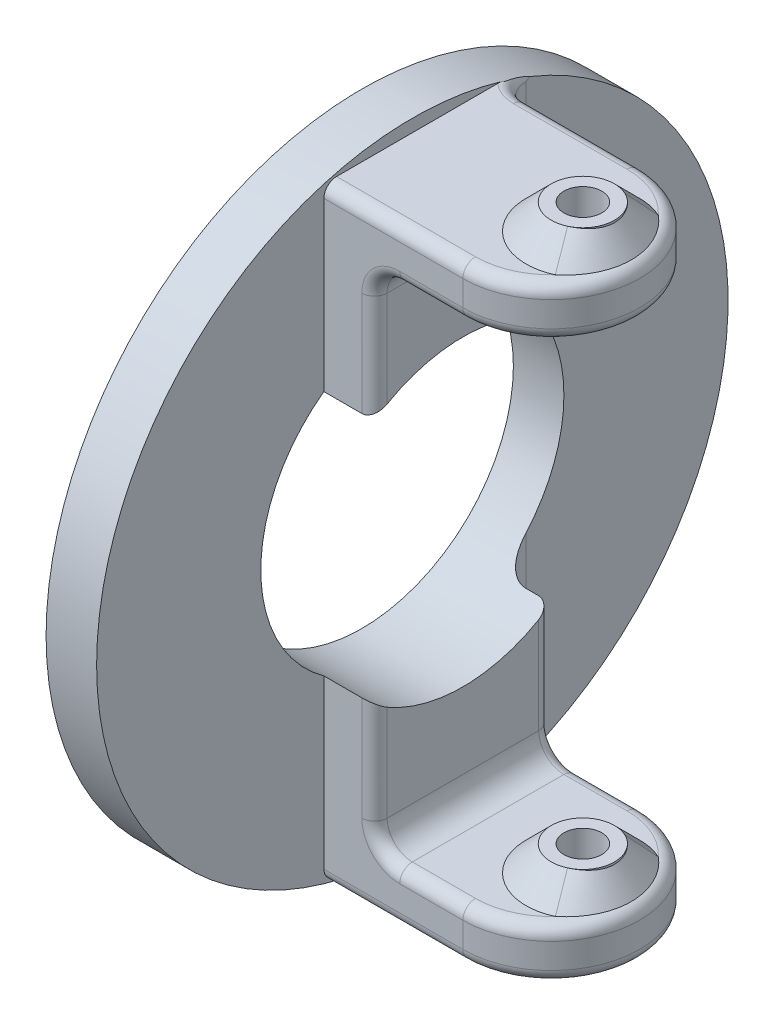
ISO-10303-21;
HEADER;
FILE_DESCRIPTION(('STEP AP214'),'2;1');
FILE_NAME('part.step','',(''),(''),'','','');
FILE_SCHEMA(('AUTOMOTIVE_DESIGN { 1 0 10303 214 1 1 1 1 }'));
ENDSEC;
DATA;
#1=APPLICATION_CONTEXT('core data for automotive mechanical design processes');
#2=APPLICATION_PROTOCOL_DEFINITION('international standard','automotive_design',2000,#1);
#3=PRODUCT_CONTEXT('',#1,'mechanical');
#4=PRODUCT('Part','Part','',(#3));
#5=PRODUCT_RELATED_PRODUCT_CATEGORY('part','',(#4));
#6=PRODUCT_DEFINITION_FORMATION('','',#4);
#7=PRODUCT_DEFINITION_CONTEXT('part definition',#1,'design');
#8=PRODUCT_DEFINITION('design','',#6,#7);
#9=PRODUCT_DEFINITION_SHAPE('','',#8);
#10=(LENGTH_UNIT() NAMED_UNIT(*) SI_UNIT(.MILLI.,.METRE.));
#11=(NAMED_UNIT(*) PLANE_ANGLE_UNIT() SI_UNIT($,.RADIAN.));
#12=(NAMED_UNIT(*) SI_UNIT($,.STERADIAN.) SOLID_ANGLE_UNIT());
#13=UNCERTAINTY_MEASURE_WITH_UNIT(LENGTH_MEASURE(1.E-05),#10,'distance_accuracy_value','');
#14=(GEOMETRIC_REPRESENTATION_CONTEXT(3) GLOBAL_UNCERTAINTY_ASSIGNED_CONTEXT((#13)) GLOBAL_UNIT_ASSIGNED_CONTEXT((#10,
#11,#12)) REPRESENTATION_CONTEXT('',''));
#15=CARTESIAN_POINT('',(0.,0.,0.));
#16=DIRECTION('',(0.,0.,1.));
#17=DIRECTION('',(1.,0.,0.));
#18=AXIS2_PLACEMENT_3D('',#15,#16,#17);
#19=CARTESIAN_POINT('',(-34.925,152.4,-22.2249999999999));
#20=DIRECTION('',(0.,-1.,0.));
#21=DIRECTION('',(0.,0.,-0.999999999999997));
#22=AXIS2_PLACEMENT_3D('',#19,#20,#21);
#23=PLANE('',#22);
#24=CARTESIAN_POINT('',(0.,152.4,0.));
#25=DIRECTION('',(0.,-1.,0.));
#26=DIRECTION('',(0.,0.,-0.999999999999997));
#27=AXIS2_PLACEMENT_3D('',#24,#25,#26);
#28=CIRCLE('',#27,19.05);
#29=CARTESIAN_POINT('',(0.,152.4,19.0499999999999));
#30=VERTEX_POINT('',#29);
#31=CARTESIAN_POINT('',(13.97,152.4,12.9515095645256));
#32=VERTEX_POINT('',#31);
#33=EDGE_CURVE('E547',#30,#32,#28,.F.);
#34=ORIENTED_EDGE('',*,*,#33,.T.);
#35=CARTESIAN_POINT('',(7.93749999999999,152.4,0.));
#36=DIRECTION('',(0.,-1.,0.));
#37=DIRECTION('',(0.,0.,-0.999999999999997));
#38=AXIS2_PLACEMENT_3D('',#35,#36,#37);
#39=CIRCLE('',#38,14.2875);
#40=CARTESIAN_POINT('',(13.97,152.4,-12.9515095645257));
#41=VERTEX_POINT('',#40);
#42=EDGE_CURVE('E815',#32,#41,#39,.T.);
#43=ORIENTED_EDGE('',*,*,#42,.T.);
#44=CARTESIAN_POINT('',(0.,152.4,-19.0499999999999));
#45=VERTEX_POINT('',#44);
#46=EDGE_CURVE('E538',#41,#45,#28,.F.);
#47=ORIENTED_EDGE('',*,*,#46,.T.);
#48=DIRECTION('',(1.,0.,0.));
#49=VECTOR('',#48,1.);
#50=CARTESIAN_POINT('',(-34.925,152.4,-19.0499999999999));
#51=LINE('',#50,#49);
#52=CARTESIAN_POINT('',(-28.575,152.4,-19.0499999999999));
#53=VERTEX_POINT('',#52);
#54=EDGE_CURVE('E801',#45,#53,#51,.F.);
#55=ORIENTED_EDGE('',*,*,#54,.T.);
#56=CARTESIAN_POINT('',(-28.575,152.4,-28.5749999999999));
#57=DIRECTION('',(0.,-1.,0.));
#58=DIRECTION('',(0.,0.,-0.999999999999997));
#59=AXIS2_PLACEMENT_3D('',#56,#57,#58);
#60=CIRCLE('',#59,9.525);
#61=CARTESIAN_POINT('',(-34.925,152.4,-21.4754841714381));
#62=VERTEX_POINT('',#61);
#63=EDGE_CURVE('E771',#53,#62,#60,.T.);
#64=ORIENTED_EDGE('',*,*,#63,.T.);
#65=DIRECTION('',(0.,0.,-0.999999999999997));
#66=VECTOR('',#65,1.);
#67=CARTESIAN_POINT('',(-34.925,152.4,-22.2249999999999));
#68=LINE('',#67,#66);
#69=CARTESIAN_POINT('',(-34.925,152.4,19.0499999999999));
#70=VERTEX_POINT('',#69);
#71=EDGE_CURVE('E285',#70,#62,#68,.T.);
#72=ORIENTED_EDGE('',*,*,#71,.F.);
#73=DIRECTION('',(1.,0.,0.));
#74=VECTOR('',#73,1.);
#75=CARTESIAN_POINT('',(-34.925,152.4,19.0499999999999));
#76=LINE('',#75,#74);
#77=EDGE_CURVE('E541',#70,#30,#76,.T.);
#78=ORIENTED_EDGE('',*,*,#77,.T.);
#79=EDGE_LOOP('',(#34,#43,#47,#55,#64,#72,#78));
#80=FACE_BOUND('',#79,.T.);
#81=ADVANCED_FACE('F34',(#80),#23,.F.);
#82=CARTESIAN_POINT('',(0.,12.7,0.));
#83=DIRECTION('',(0.,1.,0.));
#84=DIRECTION('',(0.,0.,0.999999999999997));
#85=AXIS2_PLACEMENT_3D('',#82,#83,#84);
#86=PLANE('',#85);
#87=CARTESIAN_POINT('',(0.,12.7,0.));
#88=DIRECTION('',(0.,1.,0.));
#89=DIRECTION('',(0.,0.,0.999999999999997));
#90=AXIS2_PLACEMENT_3D('',#87,#88,#89);
#91=CIRCLE('',#90,19.05);
#92=CARTESIAN_POINT('',(0.,12.7,19.0499999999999));
#93=VERTEX_POINT('',#92);
#94=CARTESIAN_POINT('',(13.97,12.7,12.9515095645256));
#95=VERTEX_POINT('',#94);
#96=EDGE_CURVE('E438',#93,#95,#91,.T.);
#97=ORIENTED_EDGE('',*,*,#96,.T.);
#98=CARTESIAN_POINT('',(7.93750000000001,12.7,0.));
#99=DIRECTION('',(0.,1.,0.));
#100=DIRECTION('',(0.,0.,0.999999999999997));
#101=AXIS2_PLACEMENT_3D('',#98,#99,#100);
#102=CIRCLE('',#101,14.2875);
#103=CARTESIAN_POINT('',(13.97,12.7,-12.9515095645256));
#104=VERTEX_POINT('',#103);
#105=EDGE_CURVE('E45',#95,#104,#102,.F.);
#106=ORIENTED_EDGE('',*,*,#105,.T.);
#107=CARTESIAN_POINT('',(0.,12.7,-19.0499999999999));
#108=VERTEX_POINT('',#107);
#109=EDGE_CURVE('E429',#104,#108,#91,.T.);
#110=ORIENTED_EDGE('',*,*,#109,.T.);
#111=DIRECTION('',(-1.,0.,0.));
#112=VECTOR('',#111,1.);
#113=CARTESIAN_POINT('',(-15.875,12.7,-19.0499999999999));
#114=LINE('',#113,#112);
#115=CARTESIAN_POINT('',(-15.875,12.7,-19.0499999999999));
#116=VERTEX_POINT('',#115);
#117=EDGE_CURVE('E432',#108,#116,#114,.T.);
#118=ORIENTED_EDGE('',*,*,#117,.T.);
#119=DIRECTION('',(0.,0.,0.999999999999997));
#120=VECTOR('',#119,1.);
#121=CARTESIAN_POINT('',(-15.875,12.7,22.2249999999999));
#122=LINE('',#121,#120);
#123=CARTESIAN_POINT('',(-15.875,12.7,19.0499999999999));
#124=VERTEX_POINT('',#123);
#125=EDGE_CURVE('E350',#116,#124,#122,.T.);
#126=ORIENTED_EDGE('',*,*,#125,.T.);
#127=DIRECTION('',(1.,0.,0.));
#128=VECTOR('',#127,1.);
#129=CARTESIAN_POINT('',(0.,12.7,19.0499999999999));
#130=LINE('',#129,#128);
#131=EDGE_CURVE('E1201',#124,#93,#130,.T.);
#132=ORIENTED_EDGE('',*,*,#131,.T.);
#133=EDGE_LOOP('',(#97,#106,#110,#118,#126,#132));
#134=FACE_BOUND('',#133,.T.);
#135=ADVANCED_FACE('F473',(#134),#86,.T.);
#136=CARTESIAN_POINT('',(-22.225,152.4,-22.2249999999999));
#137=DIRECTION('',(1.,0.,0.));
#138=DIRECTION('',(0.,0.,-0.999999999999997));
#139=AXIS2_PLACEMENT_3D('',#136,#137,#138);
#140=PLANE('',#139);
#141=CARTESIAN_POINT('',(-22.225,76.2,0.));
#142=DIRECTION('',(1.,0.,0.));
#143=DIRECTION('',(0.,0.,-0.999999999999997));
#144=AXIS2_PLACEMENT_3D('',#141,#142,#143);
#145=CIRCLE('',#144,38.1);
#146=CARTESIAN_POINT('',(-22.225,109.195567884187,-19.0499999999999));
#147=VERTEX_POINT('',#146);
#148=CARTESIAN_POINT('',(-22.225,109.195567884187,19.0499999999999));
#149=VERTEX_POINT('',#148);
#150=EDGE_CURVE('E302',#147,#149,#145,.T.);
#151=ORIENTED_EDGE('',*,*,#150,.F.);
#152=DIRECTION('',(0.,-1.,0.));
#153=VECTOR('',#152,1.);
#154=CARTESIAN_POINT('',(-22.225,133.35,-19.0499999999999));
#155=LINE('',#154,#153);
#156=CARTESIAN_POINT('',(-22.225,133.35,-19.0499999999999));
#157=VERTEX_POINT('',#156);
#158=EDGE_CURVE('E722',#147,#157,#155,.F.);
#159=ORIENTED_EDGE('',*,*,#158,.T.);
#160=DIRECTION('',(0.,0.,-0.999999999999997));
#161=VECTOR('',#160,1.);
#162=CARTESIAN_POINT('',(-22.225,133.35,-22.2249999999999));
#163=LINE('',#162,#161);
#164=CARTESIAN_POINT('',(-22.225,133.35,19.0499999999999));
#165=VERTEX_POINT('',#164);
#166=EDGE_CURVE('E359',#157,#165,#163,.F.);
#167=ORIENTED_EDGE('',*,*,#166,.T.);
#168=DIRECTION('',(0.,1.,0.));
#169=VECTOR('',#168,1.);
#170=CARTESIAN_POINT('',(-22.225,107.146072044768,19.0499999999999));
#171=LINE('',#170,#169);
#172=EDGE_CURVE('E720',#165,#149,#171,.F.);
#173=ORIENTED_EDGE('',*,*,#172,.T.);
#174=EDGE_LOOP('',(#151,#159,#167,#173));
#175=FACE_BOUND('',#174,.T.);
#176=ADVANCED_FACE('F479',(#175),#140,.T.);
#177=CARTESIAN_POINT('',(-22.225,12.7000000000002,-22.2249999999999));
#178=DIRECTION('',(0.,0.,0.999999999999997));
#179=DIRECTION('',(1.,0.,0.));
#180=AXIS2_PLACEMENT_3D('',#177,#178,#179);
#181=PLANE('',#180);
#182=DIRECTION('',(1.,0.,0.));
#183=VECTOR('',#182,1.);
#184=CARTESIAN_POINT('',(-47.625,45.2539279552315,-22.2249999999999));
#185=LINE('',#184,#183);
#186=CARTESIAN_POINT('',(-28.575,45.2539279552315,-22.2249999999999));
#187=VERTEX_POINT('',#186);
#188=CARTESIAN_POINT('',(-25.4,45.2539279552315,-22.2249999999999));
#189=VERTEX_POINT('',#188);
#190=EDGE_CURVE('E313',#187,#189,#185,.T.);
#191=ORIENTED_EDGE('',*,*,#190,.T.);
#192=DIRECTION('',(0.,-1.,0.));
#193=VECTOR('',#192,1.);
#194=CARTESIAN_POINT('',(-25.4,19.0500000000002,-22.2249999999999));
#195=LINE('',#194,#193);
#196=CARTESIAN_POINT('',(-25.4,19.0500000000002,-22.2249999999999));
#197=VERTEX_POINT('',#196);
#198=EDGE_CURVE('E511',#189,#197,#195,.T.);
#199=ORIENTED_EDGE('',*,*,#198,.T.);
#200=CARTESIAN_POINT('',(-15.875,19.0500000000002,-22.2249999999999));
#201=DIRECTION('',(0.,0.,0.999999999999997));
#202=DIRECTION('',(1.,0.,0.));
#203=AXIS2_PLACEMENT_3D('',#200,#201,#202);
#204=CIRCLE('',#203,9.525);
#205=CARTESIAN_POINT('',(-15.875,9.52500000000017,-22.2249999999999));
#206=VERTEX_POINT('',#205);
#207=EDGE_CURVE('E521',#197,#206,#204,.T.);
#208=ORIENTED_EDGE('',*,*,#207,.T.);
#209=DIRECTION('',(-1.,0.,0.));
#210=VECTOR('',#209,1.);
#211=CARTESIAN_POINT('',(0.,9.52500000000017,-22.2249999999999));
#212=LINE('',#211,#210);
#213=CARTESIAN_POINT('',(0.,9.52500000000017,-22.2249999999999));
#214=VERTEX_POINT('',#213);
#215=EDGE_CURVE('E526',#206,#214,#212,.F.);
#216=ORIENTED_EDGE('',*,*,#215,.T.);
#217=DIRECTION('',(0.,-1.,0.));
#218=VECTOR('',#217,1.);
#219=CARTESIAN_POINT('',(0.,12.7000000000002,-22.2249999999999));
#220=LINE('',#219,#218);
#221=CARTESIAN_POINT('',(0.,3.17500000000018,-22.2249999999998));
#222=VERTEX_POINT('',#221);
#223=EDGE_CURVE('E337',#214,#222,#220,.T.);
#224=ORIENTED_EDGE('',*,*,#223,.T.);
#225=DIRECTION('',(-1.,0.,0.));
#226=VECTOR('',#225,1.);
#227=CARTESIAN_POINT('',(-22.225,3.17500000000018,-22.2249999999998));
#228=LINE('',#227,#226);
#229=CARTESIAN_POINT('',(-28.575,3.17500000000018,-22.2249999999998));
#230=VERTEX_POINT('',#229);
#231=EDGE_CURVE('E644',#222,#230,#228,.T.);
#232=ORIENTED_EDGE('',*,*,#231,.T.);
#233=DIRECTION('',(0.,-1.,0.));
#234=VECTOR('',#233,1.);
#235=CARTESIAN_POINT('',(-28.575,45.2539279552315,-22.2249999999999));
#236=LINE('',#235,#234);
#237=EDGE_CURVE('E348',#230,#187,#236,.F.);
#238=ORIENTED_EDGE('',*,*,#237,.T.);
#239=EDGE_LOOP('',(#191,#199,#208,#216,#224,#232,#238));
#240=FACE_BOUND('',#239,.T.);
#241=ADVANCED_FACE('F496',(#240),#181,.F.);
#242=CARTESIAN_POINT('',(0.,12.7,22.2249999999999));
#243=DIRECTION('',(0.,0.,-0.999999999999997));
#244=DIRECTION('',(-1.,0.,0.));
#245=AXIS2_PLACEMENT_3D('',#242,#243,#244);
#246=PLANE('',#245);
#247=DIRECTION('',(0.,1.,0.));
#248=VECTOR('',#247,1.);
#249=CARTESIAN_POINT('',(0.,139.7,22.2249999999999));
#250=LINE('',#249,#248);
#251=CARTESIAN_POINT('',(0.,142.875,22.2249999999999));
#252=VERTEX_POINT('',#251);
#253=CARTESIAN_POINT('',(0.,149.225,22.2249999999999));
#254=VERTEX_POINT('',#253);
#255=EDGE_CURVE('E325',#252,#254,#250,.T.);
#256=ORIENTED_EDGE('',*,*,#255,.T.);
#257=DIRECTION('',(1.,0.,0.));
#258=VECTOR('',#257,1.);
#259=CARTESIAN_POINT('',(0.,149.225,22.2249999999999));
#260=LINE('',#259,#258);
#261=CARTESIAN_POINT('',(-34.925,149.225,22.2249999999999));
#262=VERTEX_POINT('',#261);
#263=EDGE_CURVE('E718',#254,#262,#260,.F.);
#264=ORIENTED_EDGE('',*,*,#263,.T.);
#265=DIRECTION('',(0.,1.,0.));
#266=VECTOR('',#265,1.);
#267=CARTESIAN_POINT('',(-34.925,0.,22.2249999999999));
#268=LINE('',#267,#266);
#269=CARTESIAN_POINT('',(-34.925,107.146072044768,22.2249999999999));
#270=VERTEX_POINT('',#269);
#271=EDGE_CURVE('E286',#270,#262,#268,.T.);
#272=ORIENTED_EDGE('',*,*,#271,.F.);
#273=DIRECTION('',(1.,0.,0.));
#274=VECTOR('',#273,1.);
#275=CARTESIAN_POINT('',(-47.625,107.146072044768,22.2249999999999));
#276=LINE('',#275,#274);
#277=CARTESIAN_POINT('',(-25.4,107.146072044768,22.2249999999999));
#278=VERTEX_POINT('',#277);
#279=EDGE_CURVE('E295',#270,#278,#276,.T.);
#280=ORIENTED_EDGE('',*,*,#279,.T.);
#281=DIRECTION('',(0.,1.,0.));
#282=VECTOR('',#281,1.);
#283=CARTESIAN_POINT('',(-25.4,133.35,22.2249999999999));
#284=LINE('',#283,#282);
#285=CARTESIAN_POINT('',(-25.4,133.35,22.2249999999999));
#286=VERTEX_POINT('',#285);
#287=EDGE_CURVE('E716',#278,#286,#284,.T.);
#288=ORIENTED_EDGE('',*,*,#287,.T.);
#289=CARTESIAN_POINT('',(-15.875,133.35,22.2249999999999));
#290=DIRECTION('',(0.,0.,-0.999999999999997));
#291=DIRECTION('',(-1.,0.,0.));
#292=AXIS2_PLACEMENT_3D('',#289,#290,#291);
#293=CIRCLE('',#292,9.525);
#294=CARTESIAN_POINT('',(-15.875,142.875,22.2249999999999));
#295=VERTEX_POINT('',#294);
#296=EDGE_CURVE('E714',#286,#295,#293,.T.);
#297=ORIENTED_EDGE('',*,*,#296,.T.);
#298=DIRECTION('',(1.,0.,0.));
#299=VECTOR('',#298,1.);
#300=CARTESIAN_POINT('',(0.,142.875,22.2249999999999));
#301=LINE('',#300,#299);
#302=EDGE_CURVE('E708',#295,#252,#301,.T.);
#303=ORIENTED_EDGE('',*,*,#302,.T.);
#304=EDGE_LOOP('',(#256,#264,#272,#280,#288,#297,#303));
#305=FACE_BOUND('',#304,.T.);
#306=ADVANCED_FACE('F493',(#305),#246,.F.);
#307=CARTESIAN_POINT('',(-22.225,43.2044321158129,19.0499999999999));
#308=VERTEX_POINT('',#307);
#309=CARTESIAN_POINT('',(-22.225,43.2044321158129,-19.0499999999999));
#310=VERTEX_POINT('',#309);
#311=EDGE_CURVE('E305',#308,#310,#145,.T.);
#312=ORIENTED_EDGE('',*,*,#311,.F.);
#313=DIRECTION('',(0.,1.,0.));
#314=VECTOR('',#313,1.);
#315=CARTESIAN_POINT('',(-22.225,19.05,19.0499999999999));
#316=LINE('',#315,#314);
#317=CARTESIAN_POINT('',(-22.225,19.05,19.0499999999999));
#318=VERTEX_POINT('',#317);
#319=EDGE_CURVE('E423',#308,#318,#316,.F.);
#320=ORIENTED_EDGE('',*,*,#319,.T.);
#321=DIRECTION('',(0.,0.,0.999999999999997));
#322=VECTOR('',#321,1.);
#323=CARTESIAN_POINT('',(-22.225,19.0500000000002,-22.2249999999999));
#324=LINE('',#323,#322);
#325=CARTESIAN_POINT('',(-22.225,19.05,-19.0499999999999));
#326=VERTEX_POINT('',#325);
#327=EDGE_CURVE('E353',#318,#326,#324,.F.);
#328=ORIENTED_EDGE('',*,*,#327,.T.);
#329=DIRECTION('',(0.,-1.,0.));
#330=VECTOR('',#329,1.);
#331=CARTESIAN_POINT('',(-22.225,45.2539279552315,-19.0499999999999));
#332=LINE('',#331,#330);
#333=EDGE_CURVE('E415',#326,#310,#332,.F.);
#334=ORIENTED_EDGE('',*,*,#333,.T.);
#335=EDGE_LOOP('',(#312,#320,#328,#334));
#336=FACE_BOUND('',#335,.T.);
#337=ADVANCED_FACE('F483',(#336),#140,.T.);
#338=CARTESIAN_POINT('',(0.,0.,0.));
#339=DIRECTION('',(0.,1.,0.));
#340=DIRECTION('',(0.,0.,0.999999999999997));
#341=AXIS2_PLACEMENT_3D('',#338,#339,#340);
#342=PLANE('',#341);
#343=CARTESIAN_POINT('',(7.93750000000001,0.,0.));
#344=DIRECTION('',(0.,-1.,0.));
#345=DIRECTION('',(0.,0.,-0.999999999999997));
#346=AXIS2_PLACEMENT_3D('',#343,#344,#345);
#347=CIRCLE('',#346,4.7625);
#348=CARTESIAN_POINT('',(7.93750000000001,0.,-4.76249999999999));
#349=VERTEX_POINT('',#348);
#350=EDGE_CURVE('E586',#349,#349,#347,.T.);
#351=ORIENTED_EDGE('',*,*,#350,.F.);
#352=EDGE_LOOP('',(#351));
#353=FACE_BOUND('',#352,.T.);
#354=CARTESIAN_POINT('',(0.,0.,0.));
#355=DIRECTION('',(0.,1.,0.));
#356=DIRECTION('',(0.,0.,0.999999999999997));
#357=AXIS2_PLACEMENT_3D('',#354,#355,#356);
#358=CIRCLE('',#357,19.05);
#359=CARTESIAN_POINT('',(0.,0.,-19.0499999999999));
#360=VERTEX_POINT('',#359);
#361=CARTESIAN_POINT('',(0.,0.,19.0499999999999));
#362=VERTEX_POINT('',#361);
#363=EDGE_CURVE('E734',#360,#362,#358,.F.);
#364=ORIENTED_EDGE('',*,*,#363,.T.);
#365=DIRECTION('',(1.,0.,0.));
#366=VECTOR('',#365,1.);
#367=CARTESIAN_POINT('',(0.,0.,19.0499999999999));
#368=LINE('',#367,#366);
#369=CARTESIAN_POINT('',(-34.925,0.,19.0499999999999));
#370=VERTEX_POINT('',#369);
#371=EDGE_CURVE('E658',#362,#370,#368,.F.);
#372=ORIENTED_EDGE('',*,*,#371,.T.);
#373=DIRECTION('',(0.,0.,0.999999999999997));
#374=VECTOR('',#373,1.);
#375=CARTESIAN_POINT('',(-34.925,1.80411241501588E-13,-22.2249999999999));
#376=LINE('',#375,#374);
#377=CARTESIAN_POINT('',(-34.925,1.80411241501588E-13,-21.4754841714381));
#378=VERTEX_POINT('',#377);
#379=EDGE_CURVE('E328',#378,#370,#376,.T.);
#380=ORIENTED_EDGE('',*,*,#379,.F.);
#381=CARTESIAN_POINT('',(-28.575,1.80411241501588E-13,-28.5749999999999));
#382=DIRECTION('',(0.,1.,0.));
#383=DIRECTION('',(0.,0.,0.999999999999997));
#384=AXIS2_PLACEMENT_3D('',#381,#382,#383);
#385=CIRCLE('',#384,9.525);
#386=CARTESIAN_POINT('',(-28.575,0.,-19.0499999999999));
#387=VERTEX_POINT('',#386);
#388=EDGE_CURVE('E652',#378,#387,#385,.T.);
#389=ORIENTED_EDGE('',*,*,#388,.T.);
#390=DIRECTION('',(-1.,0.,0.));
#391=VECTOR('',#390,1.);
#392=CARTESIAN_POINT('',(0.,0.,-19.0499999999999));
#393=LINE('',#392,#391);
#394=EDGE_CURVE('E645',#387,#360,#393,.F.);
#395=ORIENTED_EDGE('',*,*,#394,.T.);
#396=EDGE_LOOP('',(#364,#372,#380,#389,#395));
#397=FACE_BOUND('',#396,.T.);
#398=ADVANCED_FACE('F486',(#353,#397),#342,.F.);
#399=CARTESIAN_POINT('',(0.,12.7,0.));
#400=DIRECTION('',(0.,-1.,0.));
#401=DIRECTION('',(0.,0.,-0.999999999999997));
#402=AXIS2_PLACEMENT_3D('',#399,#400,#401);
#403=CYLINDRICAL_SURFACE('',#402,22.225);
#404=ORIENTED_EDGE('',*,*,#223,.F.);
#405=CARTESIAN_POINT('',(0.,9.52499999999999,0.));
#406=DIRECTION('',(0.,1.,0.));
#407=DIRECTION('',(0.,0.,0.999999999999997));
#408=AXIS2_PLACEMENT_3D('',#405,#406,#407);
#409=CIRCLE('',#408,22.225);
#410=CARTESIAN_POINT('',(0.,9.52500000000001,22.2249999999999));
#411=VERTEX_POINT('',#410);
#412=EDGE_CURVE('E660',#214,#411,#409,.F.);
#413=ORIENTED_EDGE('',*,*,#412,.T.);
#414=DIRECTION('',(0.,-1.,0.));
#415=VECTOR('',#414,1.);
#416=CARTESIAN_POINT('',(0.,12.7,22.2249999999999));
#417=LINE('',#416,#415);
#418=CARTESIAN_POINT('',(0.,3.17500000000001,22.2249999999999));
#419=VERTEX_POINT('',#418);
#420=EDGE_CURVE('E334',#411,#419,#417,.T.);
#421=ORIENTED_EDGE('',*,*,#420,.T.);
#422=CARTESIAN_POINT('',(0.,3.175,0.));
#423=DIRECTION('',(0.,1.,0.));
#424=DIRECTION('',(0.,0.,0.999999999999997));
#425=AXIS2_PLACEMENT_3D('',#422,#423,#424);
#426=CIRCLE('',#425,22.225);
#427=EDGE_CURVE('E657',#419,#222,#426,.T.);
#428=ORIENTED_EDGE('',*,*,#427,.T.);
#429=EDGE_LOOP('',(#404,#413,#421,#428));
#430=FACE_BOUND('',#429,.T.);
#431=ADVANCED_FACE('F385',(#430),#403,.T.);
#432=DIRECTION('',(0.,-1.,0.));
#433=VECTOR('',#432,1.);
#434=CARTESIAN_POINT('',(-28.575,152.4,-22.2249999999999));
#435=LINE('',#434,#433);
#436=CARTESIAN_POINT('',(-28.575,107.146072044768,-22.2249999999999));
#437=VERTEX_POINT('',#436);
#438=CARTESIAN_POINT('',(-28.575,149.225,-22.2249999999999));
#439=VERTEX_POINT('',#438);
#440=EDGE_CURVE('E345',#437,#439,#435,.F.);
#441=ORIENTED_EDGE('',*,*,#440,.T.);
#442=DIRECTION('',(1.,0.,0.));
#443=VECTOR('',#442,1.);
#444=CARTESIAN_POINT('',(-22.225,149.225,-22.2249999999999));
#445=LINE('',#444,#443);
#446=CARTESIAN_POINT('',(0.,149.225,-22.2249999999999));
#447=VERTEX_POINT('',#446);
#448=EDGE_CURVE('E536',#439,#447,#445,.T.);
#449=ORIENTED_EDGE('',*,*,#448,.T.);
#450=DIRECTION('',(0.,1.,0.));
#451=VECTOR('',#450,1.);
#452=CARTESIAN_POINT('',(0.,139.7,-22.2249999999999));
#453=LINE('',#452,#451);
#454=CARTESIAN_POINT('',(0.,142.875,-22.2249999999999));
#455=VERTEX_POINT('',#454);
#456=EDGE_CURVE('E320',#455,#447,#453,.T.);
#457=ORIENTED_EDGE('',*,*,#456,.F.);
#458=DIRECTION('',(1.,0.,0.));
#459=VECTOR('',#458,1.);
#460=CARTESIAN_POINT('',(-22.225,142.875,-22.2249999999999));
#461=LINE('',#460,#459);
#462=CARTESIAN_POINT('',(-15.875,142.875,-22.2249999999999));
#463=VERTEX_POINT('',#462);
#464=EDGE_CURVE('E524',#455,#463,#461,.F.);
#465=ORIENTED_EDGE('',*,*,#464,.T.);
#466=CARTESIAN_POINT('',(-15.875,133.35,-22.2249999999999));
#467=DIRECTION('',(0.,0.,0.999999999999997));
#468=DIRECTION('',(1.,0.,0.));
#469=AXIS2_PLACEMENT_3D('',#466,#467,#468);
#470=CIRCLE('',#469,9.525);
#471=CARTESIAN_POINT('',(-25.4,133.35,-22.2249999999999));
#472=VERTEX_POINT('',#471);
#473=EDGE_CURVE('E531',#463,#472,#470,.T.);
#474=ORIENTED_EDGE('',*,*,#473,.T.);
#475=DIRECTION('',(0.,-1.,0.));
#476=VECTOR('',#475,1.);
#477=CARTESIAN_POINT('',(-25.4,107.146072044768,-22.2249999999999));
#478=LINE('',#477,#476);
#479=CARTESIAN_POINT('',(-25.4,107.146072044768,-22.2249999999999));
#480=VERTEX_POINT('',#479);
#481=EDGE_CURVE('E533',#472,#480,#478,.T.);
#482=ORIENTED_EDGE('',*,*,#481,.T.);
#483=DIRECTION('',(1.,0.,0.));
#484=VECTOR('',#483,1.);
#485=CARTESIAN_POINT('',(-47.625,107.146072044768,-22.2249999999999));
#486=LINE('',#485,#484);
#487=EDGE_CURVE('E311',#480,#437,#486,.F.);
#488=ORIENTED_EDGE('',*,*,#487,.T.);
#489=EDGE_LOOP('',(#441,#449,#457,#465,#474,#482,#488));
#490=FACE_BOUND('',#489,.T.);
#491=ADVANCED_FACE('F492',(#490),#181,.F.);
#492=CARTESIAN_POINT('',(-15.875,19.05,22.2249999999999));
#493=DIRECTION('',(0.,0.,-0.999999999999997));
#494=DIRECTION('',(-1.,0.,0.));
#495=AXIS2_PLACEMENT_3D('',#492,#493,#494);
#496=CIRCLE('',#495,9.525);
#497=CARTESIAN_POINT('',(-15.875,9.52500000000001,22.2249999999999));
#498=VERTEX_POINT('',#497);
#499=CARTESIAN_POINT('',(-25.4,19.05,22.2249999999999));
#500=VERTEX_POINT('',#499);
#501=EDGE_CURVE('E889',#498,#500,#496,.T.);
#502=ORIENTED_EDGE('',*,*,#501,.T.);
#503=DIRECTION('',(0.,1.,0.));
#504=VECTOR('',#503,1.);
#505=CARTESIAN_POINT('',(-25.4,45.2539279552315,22.2249999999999));
#506=LINE('',#505,#504);
#507=CARTESIAN_POINT('',(-25.4,45.2539279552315,22.2249999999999));
#508=VERTEX_POINT('',#507);
#509=EDGE_CURVE('E293',#500,#508,#506,.T.);
#510=ORIENTED_EDGE('',*,*,#509,.T.);
#511=DIRECTION('',(1.,0.,0.));
#512=VECTOR('',#511,1.);
#513=CARTESIAN_POINT('',(-47.625,45.2539279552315,22.2249999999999));
#514=LINE('',#513,#512);
#515=CARTESIAN_POINT('',(-34.925,45.2539279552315,22.2249999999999));
#516=VERTEX_POINT('',#515);
#517=EDGE_CURVE('E290',#508,#516,#514,.F.);
#518=ORIENTED_EDGE('',*,*,#517,.T.);
#519=CARTESIAN_POINT('',(-34.925,3.17500000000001,22.2249999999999));
#520=VERTEX_POINT('',#519);
#521=EDGE_CURVE('E272',#520,#516,#268,.T.);
#522=ORIENTED_EDGE('',*,*,#521,.F.);
#523=DIRECTION('',(1.,0.,0.));
#524=VECTOR('',#523,1.);
#525=CARTESIAN_POINT('',(0.,3.17500000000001,22.2249999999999));
#526=LINE('',#525,#524);
#527=EDGE_CURVE('E743',#520,#419,#526,.T.);
#528=ORIENTED_EDGE('',*,*,#527,.T.);
#529=ORIENTED_EDGE('',*,*,#420,.F.);
#530=DIRECTION('',(1.,0.,0.));
#531=VECTOR('',#530,1.);
#532=CARTESIAN_POINT('',(-15.875,9.52500000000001,22.2249999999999));
#533=LINE('',#532,#531);
#534=EDGE_CURVE('E870',#411,#498,#533,.F.);
#535=ORIENTED_EDGE('',*,*,#534,.T.);
#536=EDGE_LOOP('',(#502,#510,#518,#522,#528,#529,#535));
#537=FACE_BOUND('',#536,.T.);
#538=ADVANCED_FACE('F291',(#537),#246,.F.);
#539=CARTESIAN_POINT('',(0.,139.7,0.));
#540=DIRECTION('',(0.,1.,0.));
#541=DIRECTION('',(0.,0.,0.999999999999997));
#542=AXIS2_PLACEMENT_3D('',#539,#540,#541);
#543=CYLINDRICAL_SURFACE('',#542,22.225);
#544=ORIENTED_EDGE('',*,*,#456,.T.);
#545=CARTESIAN_POINT('',(0.,149.225,0.));
#546=DIRECTION('',(0.,-1.,0.));
#547=DIRECTION('',(0.,0.,-0.999999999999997));
#548=AXIS2_PLACEMENT_3D('',#545,#546,#547);
#549=CIRCLE('',#548,22.225);
#550=EDGE_CURVE('E668',#447,#254,#549,.T.);
#551=ORIENTED_EDGE('',*,*,#550,.T.);
#552=ORIENTED_EDGE('',*,*,#255,.F.);
#553=CARTESIAN_POINT('',(0.,142.875,0.));
#554=DIRECTION('',(0.,1.,0.));
#555=DIRECTION('',(0.,0.,0.999999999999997));
#556=AXIS2_PLACEMENT_3D('',#553,#554,#555);
#557=CIRCLE('',#556,22.225);
#558=EDGE_CURVE('E666',#252,#455,#557,.T.);
#559=ORIENTED_EDGE('',*,*,#558,.T.);
#560=EDGE_LOOP('',(#544,#551,#552,#559));
#561=FACE_BOUND('',#560,.T.);
#562=ADVANCED_FACE('F491',(#561),#543,.T.);
#563=CARTESIAN_POINT('',(-62.8062917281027,139.7,0.));
#564=DIRECTION('',(0.,1.,0.));
#565=DIRECTION('',(0.,0.,0.999999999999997));
#566=AXIS2_PLACEMENT_3D('',#563,#564,#565);
#567=PLANE('',#566);
#568=DIRECTION('',(0.,0.,-0.999999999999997));
#569=VECTOR('',#568,1.);
#570=CARTESIAN_POINT('',(-15.875,139.7,0.));
#571=LINE('',#570,#569);
#572=CARTESIAN_POINT('',(-15.875,139.7,19.0499999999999));
#573=VERTEX_POINT('',#572);
#574=CARTESIAN_POINT('',(-15.875,139.7,-19.0499999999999));
#575=VERTEX_POINT('',#574);
#576=EDGE_CURVE('E356',#573,#575,#571,.T.);
#577=ORIENTED_EDGE('',*,*,#576,.T.);
#578=DIRECTION('',(1.,0.,0.));
#579=VECTOR('',#578,1.);
#580=CARTESIAN_POINT('',(-62.8062917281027,139.7,-19.0499999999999));
#581=LINE('',#580,#579);
#582=CARTESIAN_POINT('',(0.,139.7,-19.0499999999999));
#583=VERTEX_POINT('',#582);
#584=EDGE_CURVE('E732',#575,#583,#581,.T.);
#585=ORIENTED_EDGE('',*,*,#584,.T.);
#586=CARTESIAN_POINT('',(0.,139.7,0.));
#587=DIRECTION('',(0.,1.,0.));
#588=DIRECTION('',(0.,0.,0.999999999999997));
#589=AXIS2_PLACEMENT_3D('',#586,#587,#588);
#590=CIRCLE('',#589,19.05);
#591=CARTESIAN_POINT('',(0.,139.7,19.0499999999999));
#592=VERTEX_POINT('',#591);
#593=EDGE_CURVE('E728',#583,#592,#590,.F.);
#594=ORIENTED_EDGE('',*,*,#593,.T.);
#595=DIRECTION('',(1.,0.,0.));
#596=VECTOR('',#595,1.);
#597=CARTESIAN_POINT('',(-62.8062917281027,139.7,19.0499999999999));
#598=LINE('',#597,#596);
#599=EDGE_CURVE('E730',#592,#573,#598,.F.);
#600=ORIENTED_EDGE('',*,*,#599,.T.);
#601=EDGE_LOOP('',(#577,#585,#594,#600));
#602=FACE_BOUND('',#601,.T.);
#603=CARTESIAN_POINT('',(7.93749999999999,139.7,0.));
#604=DIRECTION('',(0.,1.,0.));
#605=DIRECTION('',(0.,0.,0.999999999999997));
#606=AXIS2_PLACEMENT_3D('',#603,#604,#605);
#607=CIRCLE('',#606,4.7625);
#608=CARTESIAN_POINT('',(7.93749999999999,139.7,4.76249999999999));
#609=VERTEX_POINT('',#608);
#610=EDGE_CURVE('E587',#609,#609,#607,.T.);
#611=ORIENTED_EDGE('',*,*,#610,.T.);
#612=EDGE_LOOP('',(#611));
#613=FACE_BOUND('',#612,.T.);
#614=ADVANCED_FACE('F778',(#602,#613),#567,.F.);
#615=CARTESIAN_POINT('',(-34.925,76.2,0.));
#616=DIRECTION('',(-1.,0.,0.));
#617=DIRECTION('',(0.,0.,0.999999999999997));
#618=AXIS2_PLACEMENT_3D('',#615,#616,#617);
#619=PLANE('',#618);
#620=CARTESIAN_POINT('',(-34.925,76.2,0.));
#621=DIRECTION('',(-1.,0.,0.));
#622=DIRECTION('',(0.,0.,0.999999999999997));
#623=AXIS2_PLACEMENT_3D('',#620,#621,#622);
#624=CIRCLE('',#623,79.375);
#625=CARTESIAN_POINT('',(-34.925,149.883765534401,-29.5142901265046));
#626=VERTEX_POINT('',#625);
#627=CARTESIAN_POINT('',(-34.925,2.51623446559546,-29.514290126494));
#628=VERTEX_POINT('',#627);
#629=EDGE_CURVE('E323',#626,#628,#624,.T.);
#630=ORIENTED_EDGE('',*,*,#629,.F.);
#631=CARTESIAN_POINT('',(-34.925,149.883765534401,-29.5142901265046));
#632=CARTESIAN_POINT('',(-34.9249999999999,149.77668629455,-29.3590815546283));
#633=CARTESIAN_POINT('',(-34.9249999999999,149.668726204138,-29.2044895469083));
#634=CARTESIAN_POINT('',(-34.925,149.451915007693,-28.8959329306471));
#635=CARTESIAN_POINT('',(-34.925,149.343063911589,-28.7419683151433));
#636=CARTESIAN_POINT('',(-34.925,149.23113429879,-28.583675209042));
#637=CARTESIAN_POINT('',(-34.925,149.228067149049,-28.5793376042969));
#638=CARTESIAN_POINT('',(-34.925,149.225,-28.5749999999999));
#639=B_SPLINE_CURVE_WITH_KNOTS('',3,(#631,#632,#633,#634,#635,#636,#637,#638),.UNSPECIFIED.,.F.,
.F.,(4,2,2,4),(0.,0.565673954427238,1.13134161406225,1.14727899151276),.UNSPECIFIED.);
#640=CARTESIAN_POINT('',(-34.925,149.225,-28.5749999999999));
#641=VERTEX_POINT('',#640);
#642=EDGE_CURVE('E703',#626,#641,#639,.T.);
#643=ORIENTED_EDGE('',*,*,#642,.T.);
#644=DIRECTION('',(0.,-1.,0.));
#645=VECTOR('',#644,1.);
#646=CARTESIAN_POINT('',(-34.925,107.146072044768,-28.5749999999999));
#647=LINE('',#646,#645);
#648=CARTESIAN_POINT('',(-34.925,101.40078123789,-28.5749999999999));
#649=VERTEX_POINT('',#648);
#650=EDGE_CURVE('E343',#641,#649,#647,.T.);
#651=ORIENTED_EDGE('',*,*,#650,.T.);
#652=CARTESIAN_POINT('',(-34.925,76.2,0.));
#653=DIRECTION('',(-1.,0.,0.));
#654=DIRECTION('',(0.,0.,0.999999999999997));
#655=AXIS2_PLACEMENT_3D('',#652,#653,#654);
#656=CIRCLE('',#655,38.1);
#657=CARTESIAN_POINT('',(-34.925,50.9992187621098,-28.5749999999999));
#658=VERTEX_POINT('',#657);
#659=EDGE_CURVE('E308',#649,#658,#656,.T.);
#660=ORIENTED_EDGE('',*,*,#659,.T.);
#661=DIRECTION('',(0.,-1.,0.));
#662=VECTOR('',#661,1.);
#663=CARTESIAN_POINT('',(-34.925,1.80411241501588E-13,-28.5749999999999));
#664=LINE('',#663,#662);
#665=CARTESIAN_POINT('',(-34.925,3.17500000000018,-28.5749999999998));
#666=VERTEX_POINT('',#665);
#667=EDGE_CURVE('E340',#658,#666,#664,.T.);
#668=ORIENTED_EDGE('',*,*,#667,.T.);
#669=CARTESIAN_POINT('',(-34.925,2.51623446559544,-29.514290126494));
#670=CARTESIAN_POINT('',(-34.9250000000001,2.62331370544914,-29.3590815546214));
#671=CARTESIAN_POINT('',(-34.9250000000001,2.73127379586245,-29.2044895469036));
#672=CARTESIAN_POINT('',(-34.925,2.94808499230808,-28.8959329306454));
#673=CARTESIAN_POINT('',(-34.925,3.05693608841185,-28.7419683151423));
#674=CARTESIAN_POINT('',(-34.925,3.16886570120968,-28.5836752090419));
#675=CARTESIAN_POINT('',(-34.925,3.17193285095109,-28.5793376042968));
#676=CARTESIAN_POINT('',(-34.925,3.17500000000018,-28.5749999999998));
#677=B_SPLINE_CURVE_WITH_KNOTS('',3,(#669,#670,#671,#672,#673,#674,#675,#676),.UNSPECIFIED.,.F.,
.F.,(4,2,2,4),(0.,0.565673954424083,1.13134161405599,1.14727899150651),.UNSPECIFIED.);
#678=EDGE_CURVE('E655',#666,#628,#677,.F.);
#679=ORIENTED_EDGE('',*,*,#678,.T.);
#680=EDGE_LOOP('',(#630,#643,#651,#660,#668,#679));
#681=FACE_BOUND('',#680,.T.);
#682=ADVANCED_FACE('F680',(#681),#619,.F.);
#683=CARTESIAN_POINT('',(-34.925,0.0946485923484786,-22.5469756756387));
#684=VERTEX_POINT('',#683);
#685=CARTESIAN_POINT('',(-34.925,0.,22.2249999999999));
#686=VERTEX_POINT('',#685);
#687=EDGE_CURVE('E324',#684,#686,#624,.T.);
#688=ORIENTED_EDGE('',*,*,#687,.F.);
#689=CARTESIAN_POINT('',(-34.925,0.0946485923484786,-22.5469756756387));
#690=CARTESIAN_POINT('',(-34.925,0.0794260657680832,-22.4584609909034));
#691=CARTESIAN_POINT('',(-34.9250000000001,0.0658969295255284,-22.3696471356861));
#692=CARTESIAN_POINT('',(-34.9250000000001,0.0424567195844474,-22.1917078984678));
#693=CARTESIAN_POINT('',(-34.9250000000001,0.032539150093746,-22.1025833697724));
#694=CARTESIAN_POINT('',(-34.9250000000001,0.0164952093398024,-21.9239707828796));
#695=CARTESIAN_POINT('',(-34.9250000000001,0.0103695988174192,-21.8344826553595));
#696=CARTESIAN_POINT('',(-34.9250000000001,0.00211841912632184,-21.655161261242));
#697=CARTESIAN_POINT('',(-34.925,1.15273870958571E-07,-21.565327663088));
#698=CARTESIAN_POINT('',(-34.925,1.66533453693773E-13,-21.4754841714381));
#699=B_SPLINE_CURVE_WITH_KNOTS('',3,(#689,#690,#691,#692,#693,#694,#695,#696,#697,#698),
.UNSPECIFIED.,.F.,.F.,(4,2,2,2,4),(0.,0.269437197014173,0.538387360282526,0.807391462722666,
1.07688280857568),.UNSPECIFIED.);
#700=EDGE_CURVE('E739',#684,#378,#699,.T.);
#701=ORIENTED_EDGE('',*,*,#700,.T.);
#702=ORIENTED_EDGE('',*,*,#379,.T.);
#703=CARTESIAN_POINT('',(-34.925,3.17500000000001,19.0499999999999));
#704=DIRECTION('',(-1.,0.,0.));
#705=DIRECTION('',(0.,0.,0.999999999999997));
#706=AXIS2_PLACEMENT_3D('',#703,#704,#705);
#707=CIRCLE('',#706,3.175);
#708=EDGE_CURVE('E281',#370,#520,#707,.T.);
#709=ORIENTED_EDGE('',*,*,#708,.T.);
#710=ORIENTED_EDGE('',*,*,#521,.T.);
#711=CARTESIAN_POINT('',(-34.925,76.2,0.));
#712=DIRECTION('',(-1.,0.,0.));
#713=DIRECTION('',(0.,0.,0.999999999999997));
#714=AXIS2_PLACEMENT_3D('',#711,#712,#713);
#715=CIRCLE('',#714,38.1);
#716=EDGE_CURVE('E277',#516,#270,#715,.T.);
#717=ORIENTED_EDGE('',*,*,#716,.T.);
#718=ORIENTED_EDGE('',*,*,#271,.T.);
#719=CARTESIAN_POINT('',(-34.925,149.225,19.0499999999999));
#720=DIRECTION('',(-1.,0.,0.));
#721=DIRECTION('',(0.,0.,0.999999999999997));
#722=AXIS2_PLACEMENT_3D('',#719,#720,#721);
#723=CIRCLE('',#722,3.175);
#724=EDGE_CURVE('E678',#262,#70,#723,.T.);
#725=ORIENTED_EDGE('',*,*,#724,.T.);
#726=ORIENTED_EDGE('',*,*,#71,.T.);
#727=CARTESIAN_POINT('',(-34.925,152.4,-21.4754841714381));
#728=CARTESIAN_POINT('',(-34.925,152.399999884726,-21.565327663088));
#729=CARTESIAN_POINT('',(-34.925,152.397881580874,-21.6551612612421));
#730=CARTESIAN_POINT('',(-34.9249999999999,152.389630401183,-21.8344826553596));
#731=CARTESIAN_POINT('',(-34.925,152.38350479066,-21.9239707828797));
#732=CARTESIAN_POINT('',(-34.925,152.367460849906,-22.1025833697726));
#733=CARTESIAN_POINT('',(-34.9249999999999,152.357543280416,-22.191707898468));
#734=CARTESIAN_POINT('',(-34.925,152.334103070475,-22.3696471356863));
#735=CARTESIAN_POINT('',(-34.925,152.320573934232,-22.4584609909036));
#736=CARTESIAN_POINT('',(-34.925,152.305351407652,-22.546975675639));
#737=B_SPLINE_CURVE_WITH_KNOTS('',3,(#727,#728,#729,#730,#731,#732,#733,#734,#735,#736),
.UNSPECIFIED.,.F.,.F.,(4,2,2,2,4),(0.,0.269491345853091,0.538495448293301,0.807445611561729,
1.07688280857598),.UNSPECIFIED.);
#738=CARTESIAN_POINT('',(-34.925,152.305351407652,-22.546975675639));
#739=VERTEX_POINT('',#738);
#740=EDGE_CURVE('E670',#62,#739,#737,.T.);
#741=ORIENTED_EDGE('',*,*,#740,.T.);
#742=CARTESIAN_POINT('',(-34.925,152.4,22.2249999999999));
#743=VERTEX_POINT('',#742);
#744=EDGE_CURVE('E321',#743,#739,#624,.T.);
#745=ORIENTED_EDGE('',*,*,#744,.F.);
#746=EDGE_CURVE('E316',#686,#743,#624,.T.);
#747=ORIENTED_EDGE('',*,*,#746,.F.);
#748=EDGE_LOOP('',(#688,#701,#702,#709,#710,#717,#718,#725,#726,#741,#745,#747));
#749=FACE_BOUND('',#748,.T.);
#750=ADVANCED_FACE('F274',(#749),#619,.F.);
#751=CARTESIAN_POINT('',(-47.625,76.2,0.));
#752=DIRECTION('',(-1.,0.,0.));
#753=DIRECTION('',(0.,0.,0.999999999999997));
#754=AXIS2_PLACEMENT_3D('',#751,#752,#753);
#755=PLANE('',#754);
#756=CARTESIAN_POINT('',(-47.625,76.2,0.));
#757=DIRECTION('',(1.,0.,0.));
#758=DIRECTION('',(0.,0.,-0.999999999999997));
#759=AXIS2_PLACEMENT_3D('',#756,#757,#758);
#760=CIRCLE('',#759,38.1);
#761=CARTESIAN_POINT('',(-47.625,76.2,-38.0999999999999));
#762=VERTEX_POINT('',#761);
#763=EDGE_CURVE('E299',#762,#762,#760,.T.);
#764=ORIENTED_EDGE('',*,*,#763,.T.);
#765=EDGE_LOOP('',(#764));
#766=FACE_BOUND('',#765,.T.);
#767=CARTESIAN_POINT('',(-47.625,76.2,0.));
#768=DIRECTION('',(-1.,0.,0.));
#769=DIRECTION('',(0.,0.,0.999999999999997));
#770=AXIS2_PLACEMENT_3D('',#767,#768,#769);
#771=CIRCLE('',#770,79.375);
#772=CARTESIAN_POINT('',(-47.625,76.2,79.3749999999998));
#773=VERTEX_POINT('',#772);
#774=EDGE_CURVE('E317',#773,#773,#771,.T.);
#775=ORIENTED_EDGE('',*,*,#774,.T.);
#776=EDGE_LOOP('',(#775));
#777=FACE_BOUND('',#776,.T.);
#778=ADVANCED_FACE('F776',(#766,#777),#755,.T.);
#779=CARTESIAN_POINT('',(-47.625,76.2,0.));
#780=DIRECTION('',(1.,0.,0.));
#781=DIRECTION('',(0.,0.,-0.999999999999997));
#782=AXIS2_PLACEMENT_3D('',#779,#780,#781);
#783=CYLINDRICAL_SURFACE('',#782,79.375);
#784=ORIENTED_EDGE('',*,*,#774,.F.);
#785=EDGE_LOOP('',(#784));
#786=FACE_BOUND('',#785,.T.);
#787=ORIENTED_EDGE('',*,*,#744,.T.);
#788=CARTESIAN_POINT('',(-34.925,152.305351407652,-22.546975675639));
#789=CARTESIAN_POINT('',(-34.8928097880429,152.291446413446,-22.5939233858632));
#790=CARTESIAN_POINT('',(-34.8669723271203,152.276550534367,-22.6440320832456));
#791=CARTESIAN_POINT('',(-34.8259784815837,152.245903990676,-22.7467306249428));
#792=CARTESIAN_POINT('',(-34.8105685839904,152.230184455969,-22.7992257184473));
#793=CARTESIAN_POINT('',(-34.7858698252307,152.196656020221,-22.9107547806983));
#794=CARTESIAN_POINT('',(-34.7773400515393,152.178794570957,-22.969920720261));
#795=CARTESIAN_POINT('',(-34.766296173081,152.142764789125,-23.0887625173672));
#796=CARTESIAN_POINT('',(-34.7637919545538,152.124596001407,-23.1484390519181));
#797=CARTESIAN_POINT('',(-34.7629269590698,152.087722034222,-23.2690425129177));
#798=CARTESIAN_POINT('',(-34.7646578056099,152.069013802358,-23.329968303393));
#799=CARTESIAN_POINT('',(-34.77107825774,152.031515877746,-23.4515643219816));
#800=CARTESIAN_POINT('',(-34.7757653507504,152.012726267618,-23.5122347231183));
#801=CARTESIAN_POINT('',(-34.7877215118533,151.973196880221,-23.6393341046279));
#802=CARTESIAN_POINT('',(-34.7951999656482,151.952447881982,-23.7057396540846));
#803=CARTESIAN_POINT('',(-34.8117396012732,151.910831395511,-23.8383191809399));
#804=CARTESIAN_POINT('',(-34.8208009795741,151.889963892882,-23.9044931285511));
#805=CARTESIAN_POINT('',(-34.8494202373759,151.827144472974,-24.1027983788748));
#806=CARTESIAN_POINT('',(-34.8704066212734,151.784993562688,-24.2346554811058));
#807=CARTESIAN_POINT('',(-34.913095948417,151.699985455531,-24.4982042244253));
#808=CARTESIAN_POINT('',(-34.934799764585,151.657127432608,-24.6298954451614));
#809=CARTESIAN_POINT('',(-34.9771110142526,151.570679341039,-24.8931820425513));
#810=CARTESIAN_POINT('',(-34.9977187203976,151.527089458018,-25.0247774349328));
#811=CARTESIAN_POINT('',(-35.0363781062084,151.439767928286,-25.286095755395));
#812=CARTESIAN_POINT('',(-35.0544631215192,151.396047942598,-25.415817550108));
#813=CARTESIAN_POINT('',(-35.0876728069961,151.307817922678,-25.6753794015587));
#814=CARTESIAN_POINT('',(-35.1027972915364,151.263307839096,-25.8052194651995));
#815=CARTESIAN_POINT('',(-35.1428514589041,151.128624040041,-26.1947967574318));
#816=CARTESIAN_POINT('',(-35.1624803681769,151.03725752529,-26.4547085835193));
#817=CARTESIAN_POINT('',(-35.1835315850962,150.861390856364,-26.9467659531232));
#818=CARTESIAN_POINT('',(-35.1866590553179,150.777185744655,-27.1789424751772));
#819=CARTESIAN_POINT('',(-35.1781209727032,150.606700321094,-27.6422595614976));
#820=CARTESIAN_POINT('',(-35.1664566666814,150.520420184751,-27.8734002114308));
#821=CARTESIAN_POINT('',(-35.1269202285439,150.343229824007,-28.3414304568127));
#822=CARTESIAN_POINT('',(-35.098519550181,150.2522612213,-28.5782540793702));
#823=CARTESIAN_POINT('',(-35.024664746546,150.068923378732,-29.0488718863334));
#824=CARTESIAN_POINT('',(-34.9791983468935,149.976553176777,-29.2826637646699));
#825=CARTESIAN_POINT('',(-34.925,149.883765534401,-29.5142901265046));
#826=B_SPLINE_CURVE_WITH_KNOTS('',3,(#788,#789,#790,#791,#792,#793,#794,#795,#796,#797,#798,
#799,#800,#801,#802,#803,#804,#805,#806,#807,#808,#809,#810,#811,#812,#813,#814,#815,#816,#817,
#818,#819,#820,#821,#822,#823,#824,#825),.UNSPECIFIED.,.F.,.F.,(4,2,2,2,2,2,2,2,2,2,2,2,2,2,2,2,
2,2,4),(0.,0.174331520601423,0.344255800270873,0.531040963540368,0.718132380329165,
0.909307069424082,1.10031949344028,1.31020848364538,1.52012354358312,1.9401356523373,
2.3606791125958,2.78111747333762,3.19532894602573,3.60956638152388,4.43766589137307,
5.17823359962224,5.91873888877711,6.68398747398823,7.44978751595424),.UNSPECIFIED.);
#827=EDGE_CURVE('E696',#739,#626,#826,.T.);
#828=ORIENTED_EDGE('',*,*,#827,.T.);
#829=ORIENTED_EDGE('',*,*,#629,.T.);
#830=CARTESIAN_POINT('',(-34.925,2.51623446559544,-29.514290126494));
#831=CARTESIAN_POINT('',(-34.9606648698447,2.45514389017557,-29.3617789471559));
#832=CARTESIAN_POINT('',(-34.9925667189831,2.39422853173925,-29.2083251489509));
#833=CARTESIAN_POINT('',(-35.0489254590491,2.27290722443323,-28.8998784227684));
#834=CARTESIAN_POINT('',(-35.0733832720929,2.21250121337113,-28.7448856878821));
#835=CARTESIAN_POINT('',(-35.114904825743,2.09245510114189,-28.4339612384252));
#836=CARTESIAN_POINT('',(-35.1319823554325,2.03281377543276,-28.2780318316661));
#837=CARTESIAN_POINT('',(-35.1589587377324,1.91431465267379,-27.9652559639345));
#838=CARTESIAN_POINT('',(-35.1688574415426,1.85545687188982,-27.8084094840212));
#839=CARTESIAN_POINT('',(-35.1815666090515,1.73975092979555,-27.4970724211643));
#840=CARTESIAN_POINT('',(-35.1845075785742,1.68288581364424,-27.3425933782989));
#841=CARTESIAN_POINT('',(-35.1839653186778,1.57012143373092,-27.0332933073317));
#842=CARTESIAN_POINT('',(-35.1804818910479,1.51422219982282,-26.8784722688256));
#843=CARTESIAN_POINT('',(-35.1674769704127,1.40345962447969,-26.5686890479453));
#844=CARTESIAN_POINT('',(-35.1579544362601,1.34859646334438,-26.4137268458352));
#845=CARTESIAN_POINT('',(-35.1334042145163,1.23997155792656,-26.1038640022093));
#846=CARTESIAN_POINT('',(-35.1183766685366,1.18620978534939,-25.9489633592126));
#847=CARTESIAN_POINT('',(-35.0853993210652,1.08540464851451,-25.6555969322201));
#848=CARTESIAN_POINT('',(-35.0679228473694,1.0382491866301,-25.5171154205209));
#849=CARTESIAN_POINT('',(-35.0299324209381,0.944840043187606,-25.2403023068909));
#850=CARTESIAN_POINT('',(-35.0094190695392,0.898586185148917,-25.1019706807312));
#851=CARTESIAN_POINT('',(-34.9664166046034,0.806859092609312,-24.8251129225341));
#852=CARTESIAN_POINT('',(-34.943924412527,0.761387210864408,-24.6865868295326));
#853=CARTESIAN_POINT('',(-34.8986866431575,0.671220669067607,-24.4093296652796));
#854=CARTESIAN_POINT('',(-34.8759410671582,0.62652600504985,-24.2705985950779));
#855=CARTESIAN_POINT('',(-34.8347503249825,0.541464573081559,-24.0040528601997));
#856=CARTESIAN_POINT('',(-34.8161049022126,0.501046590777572,-23.8762882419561));
#857=CARTESIAN_POINT('',(-34.7927265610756,0.440748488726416,-23.6839807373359));
#858=CARTESIAN_POINT('',(-34.7856994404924,0.420706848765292,-23.6197776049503));
#859=CARTESIAN_POINT('',(-34.77401930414,0.380728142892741,-23.4911297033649));
#860=CARTESIAN_POINT('',(-34.7693656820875,0.360791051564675,-23.4266850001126));
#861=CARTESIAN_POINT('',(-34.7630426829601,0.317375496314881,-23.2857106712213));
#862=CARTESIAN_POINT('',(-34.7620793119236,0.293919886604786,-23.2091376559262));
#863=CARTESIAN_POINT('',(-34.7681018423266,0.247269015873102,-23.0560111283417));
#864=CARTESIAN_POINT('',(-34.7750894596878,0.224073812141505,-22.9794576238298));
#865=CARTESIAN_POINT('',(-34.7977034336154,0.185788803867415,-22.8524227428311));
#866=CARTESIAN_POINT('',(-34.8098573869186,0.170476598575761,-22.8014242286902));
#867=CARTESIAN_POINT('',(-34.8423390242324,0.14071353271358,-22.7019428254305));
#868=CARTESIAN_POINT('',(-34.8626200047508,0.126258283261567,-22.6534473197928));
#869=CARTESIAN_POINT('',(-34.8991939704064,0.106440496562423,-22.5867511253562));
#870=CARTESIAN_POINT('',(-34.9115576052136,0.100445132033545,-22.566542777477));
#871=CARTESIAN_POINT('',(-34.925,0.0946485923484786,-22.5469756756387));
#872=B_SPLINE_CURVE_WITH_KNOTS('',3,(#830,#831,#832,#833,#834,#835,#836,#837,#838,#839,#840,
#841,#842,#843,#844,#845,#846,#847,#848,#849,#850,#851,#852,#853,#854,#855,#856,#857,#858,#859,
#860,#861,#862,#863,#864,#865,#866,#867,#868,#869,#870,#871),.UNSPECIFIED.,.F.,.F.,(4,2,2,2,2,2,
2,2,2,2,2,2,2,2,2,2,2,2,2,2,4),(0.,0.504299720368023,1.00853694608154,1.51182795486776,
2.01512939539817,2.50891289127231,3.00271162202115,3.49659550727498,3.9904666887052,
4.43241541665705,4.87427675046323,5.31683808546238,5.75939716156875,6.16520959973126,
6.36805632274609,6.57085120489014,6.81093235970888,7.05106533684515,7.21449363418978,
7.37699592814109,7.45023068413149),.UNSPECIFIED.);
#873=EDGE_CURVE('E765',#628,#684,#872,.T.);
#874=ORIENTED_EDGE('',*,*,#873,.T.);
#875=ORIENTED_EDGE('',*,*,#687,.T.);
#876=ORIENTED_EDGE('',*,*,#746,.T.);
#877=EDGE_LOOP('',(#787,#828,#829,#874,#875,#876));
#878=FACE_BOUND('',#877,.T.);
#879=ADVANCED_FACE('F772',(#786,#878),#783,.T.);
#880=CARTESIAN_POINT('',(-47.625,76.2,0.));
#881=DIRECTION('',(1.,0.,0.));
#882=DIRECTION('',(0.,0.,-0.999999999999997));
#883=AXIS2_PLACEMENT_3D('',#880,#881,#882);
#884=CYLINDRICAL_SURFACE('',#883,38.1);
#885=ORIENTED_EDGE('',*,*,#763,.F.);
#886=EDGE_LOOP('',(#885));
#887=FACE_BOUND('',#886,.T.);
#888=ORIENTED_EDGE('',*,*,#517,.F.);
#889=CARTESIAN_POINT('',(-25.4,45.2539279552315,22.2249999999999));
#890=CARTESIAN_POINT('',(-25.322028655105,45.2539416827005,22.2250156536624));
#891=CARTESIAN_POINT('',(-25.2440680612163,45.251865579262,22.2221282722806));
#892=CARTESIAN_POINT('',(-25.0888220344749,45.2436384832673,22.2106679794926));
#893=CARTESIAN_POINT('',(-25.0115362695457,45.2374896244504,22.2020980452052));
#894=CARTESIAN_POINT('',(-24.8586660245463,45.2212699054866,22.1794603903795));
#895=CARTESIAN_POINT('',(-24.7830741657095,45.2112225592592,22.1654256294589));
#896=CARTESIAN_POINT('',(-24.6336775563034,45.1874012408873,22.1320838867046));
#897=CARTESIAN_POINT('',(-24.5598729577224,45.1736269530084,22.1127764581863));
#898=CARTESIAN_POINT('',(-24.342151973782,45.1271072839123,22.0474083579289));
#899=CARTESIAN_POINT('',(-24.2015140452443,45.0891193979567,21.9938386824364));
#900=CARTESIAN_POINT('',(-23.9321203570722,45.0014034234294,21.8692329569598));
#901=CARTESIAN_POINT('',(-23.8033813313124,44.9516591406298,21.7981728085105));
#902=CARTESIAN_POINT('',(-23.5504091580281,44.8386704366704,21.6353305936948));
#903=CARTESIAN_POINT('',(-23.4272573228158,44.7746884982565,21.5423860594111));
#904=CARTESIAN_POINT('',(-23.1981285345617,44.6385915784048,21.3424960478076));
#905=CARTESIAN_POINT('',(-23.0921558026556,44.5664746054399,21.2355471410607));
#906=CARTESIAN_POINT('',(-22.8804797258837,44.4028735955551,20.9899544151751));
#907=CARTESIAN_POINT('',(-22.7782588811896,44.3102401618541,20.8490707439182));
#908=CARTESIAN_POINT('',(-22.5990910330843,44.1199476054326,20.5550730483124));
#909=CARTESIAN_POINT('',(-22.5221724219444,44.0222829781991,20.401945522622));
#910=CARTESIAN_POINT('',(-22.3811751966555,43.8044113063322,20.0545685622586));
#911=CARTESIAN_POINT('',(-22.3228638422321,43.6836493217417,19.8582773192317));
#912=CARTESIAN_POINT('',(-22.2643070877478,43.5030046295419,19.5583800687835));
#913=CARTESIAN_POINT('',(-22.2496065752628,43.4428790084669,19.4575150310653));
#914=CARTESIAN_POINT('',(-22.2299598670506,43.3231643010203,19.2545467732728));
#915=CARTESIAN_POINT('',(-22.2250121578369,43.2635751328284,19.1524437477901));
#916=CARTESIAN_POINT('',(-22.225,43.2044321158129,19.0499999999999));
#917=B_SPLINE_CURVE_WITH_KNOTS('',3,(#889,#890,#891,#892,#893,#894,#895,#896,#897,#898,#899,
#900,#901,#902,#903,#904,#905,#906,#907,#908,#909,#910,#911,#912,#913,#914,#915,#916),
.UNSPECIFIED.,.F.,.F.,(4,2,2,2,2,2,2,2,2,2,2,2,2,4),(0.,0.233815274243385,0.467508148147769,
0.699812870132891,0.932137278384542,1.39553753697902,1.8595798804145,2.35879815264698,
2.85813890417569,3.44736741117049,4.03725486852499,4.74676898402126,5.10145225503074,
5.4560804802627),.UNSPECIFIED.);
#918=EDGE_CURVE('E409',#508,#308,#917,.T.);
#919=ORIENTED_EDGE('',*,*,#918,.T.);
#920=ORIENTED_EDGE('',*,*,#311,.T.);
#921=CARTESIAN_POINT('',(-22.225,43.2044321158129,-19.0499999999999));
#922=CARTESIAN_POINT('',(-22.2250041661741,43.2720294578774,-19.1670994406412));
#923=CARTESIAN_POINT('',(-22.2314781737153,43.3402554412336,-19.2838137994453));
#924=CARTESIAN_POINT('',(-22.2571467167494,43.4773307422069,-19.5155031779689));
#925=CARTESIAN_POINT('',(-22.2763442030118,43.5461802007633,-19.6304777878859));
#926=CARTESIAN_POINT('',(-22.3273704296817,43.6841883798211,-19.858243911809));
#927=CARTESIAN_POINT('',(-22.3592632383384,43.7533468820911,-19.9710212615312));
#928=CARTESIAN_POINT('',(-22.4354556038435,43.8908617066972,-20.1927370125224));
#929=CARTESIAN_POINT('',(-22.4797528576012,43.9592181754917,-20.3016761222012));
#930=CARTESIAN_POINT('',(-22.61931546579,44.1462664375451,-20.5965444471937));
#931=CARTESIAN_POINT('',(-22.7276267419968,44.263393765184,-20.7775063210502));
#932=CARTESIAN_POINT('',(-22.9813777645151,44.4873781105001,-21.1177888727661));
#933=CARTESIAN_POINT('',(-23.1267012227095,44.5942658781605,-21.2771749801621));
#934=CARTESIAN_POINT('',(-23.4104441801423,44.7658913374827,-21.5296026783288));
#935=CARTESIAN_POINT('',(-23.5408639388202,44.834368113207,-21.6291263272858));
#936=CARTESIAN_POINT('',(-23.8199716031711,44.9591077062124,-21.8089114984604));
#937=CARTESIAN_POINT('',(-23.9686600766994,45.0153701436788,-21.8891724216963));
#938=CARTESIAN_POINT('',(-24.2036758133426,45.0880668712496,-21.9922581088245));
#939=CARTESIAN_POINT('',(-24.2844472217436,45.1104318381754,-22.0238498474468));
#940=CARTESIAN_POINT('',(-24.4492889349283,45.1506900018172,-22.0805696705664));
#941=CARTESIAN_POINT('',(-24.5333573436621,45.1685857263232,-22.1057014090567));
#942=CARTESIAN_POINT('',(-24.7039444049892,45.1994829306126,-22.1490101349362));
#943=CARTESIAN_POINT('',(-24.7904574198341,45.2124948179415,-22.1672019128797));
#944=CARTESIAN_POINT('',(-24.9652596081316,45.2333605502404,-22.1963412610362));
#945=CARTESIAN_POINT('',(-25.0535472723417,45.2412186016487,-22.2072947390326));
#946=CARTESIAN_POINT('',(-25.1851071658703,45.2489099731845,-22.2180116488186));
#947=CARTESIAN_POINT('',(-25.2280517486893,45.2507917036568,-22.2206325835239));
#948=CARTESIAN_POINT('',(-25.313995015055,45.2533001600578,-22.2241258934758));
#949=CARTESIAN_POINT('',(-25.3569935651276,45.2539284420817,-22.2250004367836));
#950=CARTESIAN_POINT('',(-25.4,45.2539279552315,-22.2249999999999));
#951=B_SPLINE_CURVE_WITH_KNOTS('',3,(#921,#922,#923,#924,#925,#926,#927,#928,#929,#930,#931,
#932,#933,#934,#935,#936,#937,#938,#939,#940,#941,#942,#943,#944,#945,#946,#947,#948,#949,#950),
.UNSPECIFIED.,.F.,.F.,(4,2,2,2,2,2,2,2,2,2,2,2,2,2,4),(0.,0.405443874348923,0.810981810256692,
1.21859282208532,1.62612820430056,2.34593124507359,3.06350005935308,3.594805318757,
4.1261270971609,4.39449307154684,4.66270691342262,4.93034589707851,5.19776616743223,
5.32691683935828,5.45590707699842),.UNSPECIFIED.);
#952=EDGE_CURVE('E416',#310,#189,#951,.T.);
#953=ORIENTED_EDGE('',*,*,#952,.T.);
#954=ORIENTED_EDGE('',*,*,#190,.F.);
#955=CARTESIAN_POINT('',(-28.575,45.2539279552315,-22.2249999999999));
#956=CARTESIAN_POINT('',(-28.7276228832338,45.2539151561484,-22.224969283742));
#957=CARTESIAN_POINT('',(-28.8802346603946,45.2578790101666,-22.2305010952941));
#958=CARTESIAN_POINT('',(-29.1842124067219,45.2736648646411,-22.2524634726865));
#959=CARTESIAN_POINT('',(-29.3355787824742,45.2854841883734,-22.2688903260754));
#960=CARTESIAN_POINT('',(-29.6352489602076,45.3168128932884,-22.3123155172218));
#961=CARTESIAN_POINT('',(-29.7835637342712,45.3362862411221,-22.3392643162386));
#962=CARTESIAN_POINT('',(-30.0767838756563,45.3827496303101,-22.4033179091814));
#963=CARTESIAN_POINT('',(-30.2216890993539,45.4097399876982,-22.4404231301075));
#964=CARTESIAN_POINT('',(-30.506935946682,45.4709720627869,-22.5241986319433));
#965=CARTESIAN_POINT('',(-30.647282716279,45.5052052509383,-22.5708576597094));
#966=CARTESIAN_POINT('',(-30.9227850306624,45.5806765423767,-22.6731354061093));
#967=CARTESIAN_POINT('',(-31.0579385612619,45.6219173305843,-22.728757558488));
#968=CARTESIAN_POINT('',(-31.3223306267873,45.7110957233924,-22.8482443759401));
#969=CARTESIAN_POINT('',(-31.4515664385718,45.7590363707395,-22.9121127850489));
#970=CARTESIAN_POINT('',(-31.7035111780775,45.8612667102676,-23.0473089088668));
#971=CARTESIAN_POINT('',(-31.8262176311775,45.9155587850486,-23.1186394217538));
#972=CARTESIAN_POINT('',(-32.070537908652,46.0329654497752,-23.2716515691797));
#973=CARTESIAN_POINT('',(-32.1917935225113,46.0963846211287,-23.353671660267));
#974=CARTESIAN_POINT('',(-32.4262100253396,46.2293641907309,-23.5240879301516));
#975=CARTESIAN_POINT('',(-32.5393677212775,46.2989269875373,-23.6124865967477));
#976=CARTESIAN_POINT('',(-32.8661786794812,46.5161095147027,-23.8857803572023));
#977=CARTESIAN_POINT('',(-33.0674202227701,46.6723448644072,-24.0789329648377));
#978=CARTESIAN_POINT('',(-33.3845281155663,46.9577875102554,-24.4241366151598));
#979=CARTESIAN_POINT('',(-33.5085684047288,47.0824169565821,-24.5726672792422));
#980=CARTESIAN_POINT('',(-33.7394503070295,47.3406026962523,-24.8753837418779));
#981=CARTESIAN_POINT('',(-33.8462856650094,47.4741622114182,-25.0295715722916));
#982=CARTESIAN_POINT('',(-34.0436630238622,47.7496355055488,-25.3422647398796));
#983=CARTESIAN_POINT('',(-34.1341326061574,47.8915828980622,-25.5007858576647));
#984=CARTESIAN_POINT('',(-34.2990024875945,48.1823410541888,-25.8199035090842));
#985=CARTESIAN_POINT('',(-34.3733987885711,48.3311535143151,-25.9805005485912));
#986=CARTESIAN_POINT('',(-34.5260957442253,48.6782520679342,-26.348516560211));
#987=CARTESIAN_POINT('',(-34.5994057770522,48.87849508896,-26.5561648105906));
#988=CARTESIAN_POINT('',(-34.7227150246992,49.2872933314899,-26.9703734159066));
#989=CARTESIAN_POINT('',(-34.772698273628,49.4958541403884,-27.1769329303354));
#990=CARTESIAN_POINT('',(-34.8507058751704,49.9173437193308,-27.584721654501));
#991=CARTESIAN_POINT('',(-34.878974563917,50.1301953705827,-27.7859848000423));
#992=CARTESIAN_POINT('',(-34.91609073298,50.5610481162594,-28.1840473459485));
#993=CARTESIAN_POINT('',(-34.9249706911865,50.7790399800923,-28.3808536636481));
#994=CARTESIAN_POINT('',(-34.925,50.9992187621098,-28.5749999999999));
#995=B_SPLINE_CURVE_WITH_KNOTS('',3,(#955,#956,#957,#958,#959,#960,#961,#962,#963,#964,#965,
#966,#967,#968,#969,#970,#971,#972,#973,#974,#975,#976,#977,#978,#979,#980,#981,#982,#983,#984,
#985,#986,#987,#988,#989,#990,#991,#992,#993,#994),.UNSPECIFIED.,.F.,.F.,(4,2,2,2,2,2,2,2,2,2,2,
2,2,2,2,2,2,2,2,4),(0.,0.457699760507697,0.915243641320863,1.37065882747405,1.82609316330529,
2.2809941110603,2.73606974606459,3.19135272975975,3.64680705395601,4.12492523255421,
4.60323090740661,5.55888860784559,6.24859968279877,6.93856095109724,7.63150435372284,
8.32461992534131,9.2163596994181,10.1087089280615,10.9908639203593,11.8715400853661),.UNSPECIFIED.);
#996=EDGE_CURVE('E370',#187,#658,#995,.T.);
#997=ORIENTED_EDGE('',*,*,#996,.T.);
#998=ORIENTED_EDGE('',*,*,#659,.F.);
#999=CARTESIAN_POINT('',(-34.925,101.40078123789,-28.5749999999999));
#1000=CARTESIAN_POINT('',(-34.9249966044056,101.523901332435,-28.4664196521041));
#1001=CARTESIAN_POINT('',(-34.9222150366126,101.646311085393,-28.3570480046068));
#1002=CARTESIAN_POINT('',(-34.9108261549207,101.889578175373,-28.1368528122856));
#1003=CARTESIAN_POINT('',(-34.9022178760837,102.010435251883,-28.0260290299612));
#1004=CARTESIAN_POINT('',(-34.8671944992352,102.370990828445,-27.6910987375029));
#1005=CARTESIAN_POINT('',(-34.831578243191,102.608085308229,-27.4650522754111));
#1006=CARTESIAN_POINT('',(-34.7329326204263,103.076109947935,-27.0072759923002));
#1007=CARTESIAN_POINT('',(-34.6696090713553,103.306944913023,-26.7755110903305));
#1008=CARTESIAN_POINT('',(-34.513007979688,103.757361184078,-26.311715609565));
#1009=CARTESIAN_POINT('',(-34.4197660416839,103.976955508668,-26.0796856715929));
#1010=CARTESIAN_POINT('',(-34.1690247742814,104.464045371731,-25.5522224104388));
#1011=CARTESIAN_POINT('',(-34.0007674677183,104.727227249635,-25.2576807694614));
#1012=CARTESIAN_POINT('',(-33.7048031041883,105.099854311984,-24.8283022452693));
#1013=CARTESIAN_POINT('',(-33.5990951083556,105.220192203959,-24.6874702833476));
#1014=CARTESIAN_POINT('',(-33.3726940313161,105.452886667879,-24.4112901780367));
#1015=CARTESIAN_POINT('',(-33.2520035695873,105.565244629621,-24.2759410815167));
#1016=CARTESIAN_POINT('',(-33.0168295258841,105.763034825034,-24.034499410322));
#1017=CARTESIAN_POINT('',(-32.904647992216,105.849838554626,-23.9272830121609));
#1018=CARTESIAN_POINT('',(-32.6698492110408,106.016603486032,-23.7191467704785));
#1019=CARTESIAN_POINT('',(-32.5472338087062,106.0965658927,-23.6182258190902));
#1020=CARTESIAN_POINT('',(-32.2917014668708,106.249107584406,-23.4238429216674));
#1021=CARTESIAN_POINT('',(-32.1587764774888,106.321680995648,-23.3303869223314));
#1022=CARTESIAN_POINT('',(-31.8831717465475,106.458759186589,-23.1523243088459));
#1023=CARTESIAN_POINT('',(-31.7404920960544,106.523264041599,-23.0677176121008));
#1024=CARTESIAN_POINT('',(-31.4448998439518,106.644088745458,-22.9080242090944));
#1025=CARTESIAN_POINT('',(-31.29191452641,106.700339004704,-22.8330190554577));
#1026=CARTESIAN_POINT('',(-30.9777516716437,106.803450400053,-22.694631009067));
#1027=CARTESIAN_POINT('',(-30.8165753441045,106.850312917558,-22.6312464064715));
#1028=CARTESIAN_POINT('',(-30.4875089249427,106.93408127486,-22.5173543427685));
#1029=CARTESIAN_POINT('',(-30.3196294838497,106.97100224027,-22.4668273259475));
#1030=CARTESIAN_POINT('',(-29.9785214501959,107.034537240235,-22.3795493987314));
#1031=CARTESIAN_POINT('',(-29.8052957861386,107.061156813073,-22.3427910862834));
#1032=CARTESIAN_POINT('',(-29.4567151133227,107.103596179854,-22.2840538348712));
#1033=CARTESIAN_POINT('',(-29.2813954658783,107.119515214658,-22.2619391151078));
#1034=CARTESIAN_POINT('',(-29.0171397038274,107.135443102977,-22.2397938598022));
#1035=CARTESIAN_POINT('',(-28.9288587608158,107.139427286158,-22.2342499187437));
#1036=CARTESIAN_POINT('',(-28.7520572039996,107.144741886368,-22.2268522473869));
#1037=CARTESIAN_POINT('',(-28.6635365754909,107.146072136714,-22.2249987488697));
#1038=CARTESIAN_POINT('',(-28.575,107.146072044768,-22.2249999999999));
#1039=B_SPLINE_CURVE_WITH_KNOTS('',3,(#999,#1000,#1001,#1002,#1003,#1004,#1005,#1006,#1007,
#1008,#1009,#1010,#1011,#1012,#1013,#1014,#1015,#1016,#1017,#1018,#1019,#1020,#1021,#1022,#1023,
#1024,#1025,#1026,#1027,#1028,#1029,#1030,#1031,#1032,#1033,#1034,#1035,#1036,#1037,#1038),
.UNSPECIFIED.,.F.,.F.,(4,2,2,2,2,2,2,2,2,2,2,2,2,2,2,2,2,2,2,4),(0.,0.492426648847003,
0.984934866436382,1.97229863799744,2.97041025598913,3.96733844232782,5.25004719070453,
5.8892982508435,6.52843770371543,7.06135469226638,7.59417763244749,8.12742088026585,
8.66065915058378,9.19816224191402,9.73558618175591,10.2721877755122,10.8085004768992,
11.3397679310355,11.6052999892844,11.8708487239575),.UNSPECIFIED.);
#1040=EDGE_CURVE('E362',#649,#437,#1039,.T.);
#1041=ORIENTED_EDGE('',*,*,#1040,.T.);
#1042=ORIENTED_EDGE('',*,*,#487,.F.);
#1043=CARTESIAN_POINT('',(-25.4,107.146072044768,-22.2249999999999));
#1044=CARTESIAN_POINT('',(-25.322028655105,107.1460583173,-22.2250156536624));
#1045=CARTESIAN_POINT('',(-25.2440680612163,107.148134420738,-22.2221282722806));
#1046=CARTESIAN_POINT('',(-25.0888220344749,107.156361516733,-22.2106679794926));
#1047=CARTESIAN_POINT('',(-25.0115362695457,107.16251037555,-22.2020980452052));
#1048=CARTESIAN_POINT('',(-24.8586660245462,107.178730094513,-22.1794603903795));
#1049=CARTESIAN_POINT('',(-24.7830741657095,107.188777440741,-22.1654256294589));
#1050=CARTESIAN_POINT('',(-24.6336775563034,107.212598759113,-22.1320838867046));
#1051=CARTESIAN_POINT('',(-24.5598729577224,107.226373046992,-22.1127764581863));
#1052=CARTESIAN_POINT('',(-24.342151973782,107.272892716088,-22.0474083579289));
#1053=CARTESIAN_POINT('',(-24.2015140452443,107.310880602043,-21.9938386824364));
#1054=CARTESIAN_POINT('',(-23.9321203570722,107.398596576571,-21.8692329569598));
#1055=CARTESIAN_POINT('',(-23.8033813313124,107.44834085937,-21.7981728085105));
#1056=CARTESIAN_POINT('',(-23.5504091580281,107.56132956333,-21.6353305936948));
#1057=CARTESIAN_POINT('',(-23.4272573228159,107.625311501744,-21.542386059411));
#1058=CARTESIAN_POINT('',(-23.1981285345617,107.761408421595,-21.3424960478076));
#1059=CARTESIAN_POINT('',(-23.0921558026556,107.83352539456,-21.2355471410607));
#1060=CARTESIAN_POINT('',(-22.8804797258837,107.997126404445,-20.9899544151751));
#1061=CARTESIAN_POINT('',(-22.7782588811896,108.089759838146,-20.8490707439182));
#1062=CARTESIAN_POINT('',(-22.5990910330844,108.280052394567,-20.5550730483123));
#1063=CARTESIAN_POINT('',(-22.5221724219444,108.377717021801,-20.401945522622));
#1064=CARTESIAN_POINT('',(-22.3811751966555,108.595588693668,-20.0545685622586));
#1065=CARTESIAN_POINT('',(-22.3228638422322,108.716350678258,-19.8582773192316));
#1066=CARTESIAN_POINT('',(-22.2643070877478,108.896995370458,-19.5583800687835));
#1067=CARTESIAN_POINT('',(-22.2496065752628,108.957120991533,-19.4575150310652));
#1068=CARTESIAN_POINT('',(-22.2299598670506,109.07683569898,-19.2545467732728));
#1069=CARTESIAN_POINT('',(-22.2250121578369,109.136424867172,-19.1524437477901));
#1070=CARTESIAN_POINT('',(-22.225,109.195567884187,-19.0499999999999));
#1071=B_SPLINE_CURVE_WITH_KNOTS('',3,(#1043,#1044,#1045,#1046,#1047,#1048,#1049,#1050,#1051,
#1052,#1053,#1054,#1055,#1056,#1057,#1058,#1059,#1060,#1061,#1062,#1063,#1064,#1065,#1066,#1067,
#1068,#1069,#1070),.UNSPECIFIED.,.F.,.F.,(4,2,2,2,2,2,2,2,2,2,2,2,2,4),(0.,0.233815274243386,
0.467508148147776,0.699812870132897,0.932137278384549,1.39553753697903,1.85957988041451,
2.35879815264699,2.85813890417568,3.44736741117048,4.03725486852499,4.74676898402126,
5.10145225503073,5.45608048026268),.UNSPECIFIED.);
#1072=EDGE_CURVE('E839',#480,#147,#1071,.T.);
#1073=ORIENTED_EDGE('',*,*,#1072,.T.);
#1074=ORIENTED_EDGE('',*,*,#150,.T.);
#1075=CARTESIAN_POINT('',(-22.225,109.195567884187,19.0499999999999));
#1076=CARTESIAN_POINT('',(-22.2250041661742,109.127970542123,19.1670994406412));
#1077=CARTESIAN_POINT('',(-22.2314781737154,109.059744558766,19.2838137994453));
#1078=CARTESIAN_POINT('',(-22.2571467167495,108.922669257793,19.5155031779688));
#1079=CARTESIAN_POINT('',(-22.2763442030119,108.853819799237,19.6304777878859));
#1080=CARTESIAN_POINT('',(-22.3273704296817,108.715811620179,19.8582439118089));
#1081=CARTESIAN_POINT('',(-22.3592632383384,108.646653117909,19.9710212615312));
#1082=CARTESIAN_POINT('',(-22.4354556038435,108.509138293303,20.1927370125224));
#1083=CARTESIAN_POINT('',(-22.4797528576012,108.440781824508,20.3016761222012));
#1084=CARTESIAN_POINT('',(-22.61931546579,108.253733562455,20.5965444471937));
#1085=CARTESIAN_POINT('',(-22.7276267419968,108.136606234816,20.7775063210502));
#1086=CARTESIAN_POINT('',(-22.9813777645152,107.9126218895,21.1177888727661));
#1087=CARTESIAN_POINT('',(-23.1267012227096,107.805734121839,21.2771749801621));
#1088=CARTESIAN_POINT('',(-23.4104441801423,107.634108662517,21.5296026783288));
#1089=CARTESIAN_POINT('',(-23.5408639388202,107.565631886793,21.6291263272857));
#1090=CARTESIAN_POINT('',(-23.8199716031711,107.440892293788,21.8089114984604));
#1091=CARTESIAN_POINT('',(-23.9686600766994,107.384629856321,21.8891724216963));
#1092=CARTESIAN_POINT('',(-24.2036758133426,107.31193312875,21.9922581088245));
#1093=CARTESIAN_POINT('',(-24.2844472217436,107.289568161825,22.0238498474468));
#1094=CARTESIAN_POINT('',(-24.4492889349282,107.249309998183,22.0805696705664));
#1095=CARTESIAN_POINT('',(-24.5333573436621,107.231414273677,22.1057014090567));
#1096=CARTESIAN_POINT('',(-24.7039444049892,107.200517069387,22.1490101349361));
#1097=CARTESIAN_POINT('',(-24.7904574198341,107.187505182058,22.1672019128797));
#1098=CARTESIAN_POINT('',(-24.9652596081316,107.16663944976,22.1963412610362));
#1099=CARTESIAN_POINT('',(-25.0535472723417,107.158781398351,22.2072947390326));
#1100=CARTESIAN_POINT('',(-25.1851071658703,107.151090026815,22.2180116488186));
#1101=CARTESIAN_POINT('',(-25.2280517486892,107.149208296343,22.2206325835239));
#1102=CARTESIAN_POINT('',(-25.313995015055,107.146699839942,22.2241258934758));
#1103=CARTESIAN_POINT('',(-25.3569935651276,107.146071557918,22.2250004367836));
#1104=CARTESIAN_POINT('',(-25.4,107.146072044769,22.2249999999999));
#1105=B_SPLINE_CURVE_WITH_KNOTS('',3,(#1075,#1076,#1077,#1078,#1079,#1080,#1081,#1082,#1083,
#1084,#1085,#1086,#1087,#1088,#1089,#1090,#1091,#1092,#1093,#1094,#1095,#1096,#1097,#1098,#1099,
#1100,#1101,#1102,#1103,#1104),.UNSPECIFIED.,.F.,.F.,(4,2,2,2,2,2,2,2,2,2,2,2,2,2,4),(0.,
0.405443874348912,0.810981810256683,1.21859282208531,1.62612820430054,2.3459312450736,
3.06350005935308,3.59480531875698,4.12612709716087,4.39449307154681,4.66270691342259,
4.93034589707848,5.1977661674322,5.32691683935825,5.4559070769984),.UNSPECIFIED.);
#1106=EDGE_CURVE('E844',#149,#278,#1105,.T.);
#1107=ORIENTED_EDGE('',*,*,#1106,.T.);
#1108=ORIENTED_EDGE('',*,*,#279,.F.);
#1109=ORIENTED_EDGE('',*,*,#716,.F.);
#1110=EDGE_LOOP('',(#888,#919,#920,#953,#954,#997,#998,#1041,#1042,#1073,#1074,#1107,#1108,#1109));
#1111=FACE_BOUND('',#1110,.T.);
#1112=ADVANCED_FACE('F297',(#887,#1111),#884,.F.);
#1113=CARTESIAN_POINT('',(-28.575,76.2,-28.5749999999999));
#1114=DIRECTION('',(0.,1.,0.));
#1115=DIRECTION('',(0.,0.,0.999999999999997));
#1116=AXIS2_PLACEMENT_3D('',#1113,#1114,#1115);
#1117=CYLINDRICAL_SURFACE('',#1116,6.35);
#1118=ORIENTED_EDGE('',*,*,#650,.F.);
#1119=CARTESIAN_POINT('',(-28.575,149.225,-28.5749999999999));
#1120=DIRECTION('',(0.,-1.,0.));
#1121=DIRECTION('',(0.,0.,-0.999999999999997));
#1122=AXIS2_PLACEMENT_3D('',#1119,#1120,#1121);
#1123=CIRCLE('',#1122,6.35);
#1124=EDGE_CURVE('E520',#641,#439,#1123,.F.);
#1125=ORIENTED_EDGE('',*,*,#1124,.T.);
#1126=ORIENTED_EDGE('',*,*,#440,.F.);
#1127=ORIENTED_EDGE('',*,*,#1040,.F.);
#1128=EDGE_LOOP('',(#1118,#1125,#1126,#1127));
#1129=FACE_BOUND('',#1128,.T.);
#1130=ADVANCED_FACE('F379',(#1129),#1117,.F.);
#1131=CARTESIAN_POINT('',(-28.575,76.2,-28.5749999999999));
#1132=DIRECTION('',(0.,1.,0.));
#1133=DIRECTION('',(0.,0.,0.999999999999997));
#1134=AXIS2_PLACEMENT_3D('',#1131,#1132,#1133);
#1135=CYLINDRICAL_SURFACE('',#1134,6.35);
#1136=ORIENTED_EDGE('',*,*,#237,.F.);
#1137=CARTESIAN_POINT('',(-28.575,3.17500000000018,-28.5749999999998));
#1138=DIRECTION('',(0.,1.,0.));
#1139=DIRECTION('',(0.,0.,0.999999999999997));
#1140=AXIS2_PLACEMENT_3D('',#1137,#1138,#1139);
#1141=CIRCLE('',#1140,6.35);
#1142=EDGE_CURVE('E653',#230,#666,#1141,.F.);
#1143=ORIENTED_EDGE('',*,*,#1142,.T.);
#1144=ORIENTED_EDGE('',*,*,#667,.F.);
#1145=ORIENTED_EDGE('',*,*,#996,.F.);
#1146=EDGE_LOOP('',(#1136,#1143,#1144,#1145));
#1147=FACE_BOUND('',#1146,.T.);
#1148=ADVANCED_FACE('F383',(#1147),#1135,.F.);
#1149=CARTESIAN_POINT('',(-15.875,19.05,0.));
#1150=DIRECTION('',(0.,0.,-0.999999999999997));
#1151=DIRECTION('',(-1.,0.,0.));
#1152=AXIS2_PLACEMENT_3D('',#1149,#1150,#1151);
#1153=CYLINDRICAL_SURFACE('',#1152,6.35);
#1154=ORIENTED_EDGE('',*,*,#327,.F.);
#1155=CARTESIAN_POINT('',(-15.875,19.05,19.0499999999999));
#1156=DIRECTION('',(0.,0.,-0.999999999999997));
#1157=DIRECTION('',(-1.,0.,0.));
#1158=AXIS2_PLACEMENT_3D('',#1155,#1156,#1157);
#1159=CIRCLE('',#1158,6.35);
#1160=EDGE_CURVE('E427',#318,#124,#1159,.F.);
#1161=ORIENTED_EDGE('',*,*,#1160,.T.);
#1162=ORIENTED_EDGE('',*,*,#125,.F.);
#1163=CARTESIAN_POINT('',(-15.875,19.05,-19.0499999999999));
#1164=DIRECTION('',(0.,0.,0.999999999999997));
#1165=DIRECTION('',(1.,0.,0.));
#1166=AXIS2_PLACEMENT_3D('',#1163,#1164,#1165);
#1167=CIRCLE('',#1166,6.35);
#1168=EDGE_CURVE('E425',#116,#326,#1167,.F.);
#1169=ORIENTED_EDGE('',*,*,#1168,.T.);
#1170=EDGE_LOOP('',(#1154,#1161,#1162,#1169));
#1171=FACE_BOUND('',#1170,.T.);
#1172=ADVANCED_FACE('F390',(#1171),#1153,.F.);
#1173=CARTESIAN_POINT('',(-15.875,133.35,0.));
#1174=DIRECTION('',(0.,0.,-0.999999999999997));
#1175=DIRECTION('',(-1.,0.,0.));
#1176=AXIS2_PLACEMENT_3D('',#1173,#1174,#1175);
#1177=CYLINDRICAL_SURFACE('',#1176,6.35);
#1178=ORIENTED_EDGE('',*,*,#166,.F.);
#1179=CARTESIAN_POINT('',(-15.875,133.35,-19.0499999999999));
#1180=DIRECTION('',(0.,0.,0.999999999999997));
#1181=DIRECTION('',(1.,0.,0.));
#1182=AXIS2_PLACEMENT_3D('',#1179,#1180,#1181);
#1183=CIRCLE('',#1182,6.35);
#1184=EDGE_CURVE('E726',#157,#575,#1183,.F.);
#1185=ORIENTED_EDGE('',*,*,#1184,.T.);
#1186=ORIENTED_EDGE('',*,*,#576,.F.);
#1187=CARTESIAN_POINT('',(-15.875,133.35,19.0499999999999));
#1188=DIRECTION('',(0.,0.,-0.999999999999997));
#1189=DIRECTION('',(-1.,0.,0.));
#1190=AXIS2_PLACEMENT_3D('',#1187,#1188,#1189);
#1191=CIRCLE('',#1190,6.35);
#1192=EDGE_CURVE('E724',#573,#165,#1191,.F.);
#1193=ORIENTED_EDGE('',*,*,#1192,.T.);
#1194=EDGE_LOOP('',(#1178,#1185,#1186,#1193));
#1195=FACE_BOUND('',#1194,.T.);
#1196=ADVANCED_FACE('F394',(#1195),#1177,.F.);
#1197=CARTESIAN_POINT('',(7.93749999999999,165.870384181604,0.));
#1198=DIRECTION('',(0.,-1.,0.));
#1199=DIRECTION('',(0.,0.,-0.999999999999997));
#1200=AXIS2_PLACEMENT_3D('',#1197,#1198,#1199);
#1201=CYLINDRICAL_SURFACE('',#1200,4.7625);
#1202=ORIENTED_EDGE('',*,*,#610,.F.);
#1203=EDGE_LOOP('',(#1202));
#1204=FACE_BOUND('',#1203,.T.);
#1205=CARTESIAN_POINT('',(7.93749999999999,158.75,0.));
#1206=DIRECTION('',(0.,1.,0.));
#1207=DIRECTION('',(0.,0.,0.999999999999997));
#1208=AXIS2_PLACEMENT_3D('',#1205,#1206,#1207);
#1209=CIRCLE('',#1208,4.7625);
#1210=CARTESIAN_POINT('',(7.93749999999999,158.75,4.76249999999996));
#1211=VERTEX_POINT('',#1210);
#1212=EDGE_CURVE('E575',#1211,#1211,#1209,.T.);
#1213=ORIENTED_EDGE('',*,*,#1212,.T.);
#1214=EDGE_LOOP('',(#1213));
#1215=FACE_BOUND('',#1214,.T.);
#1216=ADVANCED_FACE('F398',(#1204,#1215),#1201,.F.);
#1217=ORIENTED_EDGE('',*,*,#350,.T.);
#1218=EDGE_LOOP('',(#1217));
#1219=FACE_BOUND('',#1218,.T.);
#1220=CARTESIAN_POINT('',(7.93749999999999,19.05,0.));
#1221=DIRECTION('',(0.,1.,0.));
#1222=DIRECTION('',(0.,0.,0.999999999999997));
#1223=AXIS2_PLACEMENT_3D('',#1220,#1221,#1222);
#1224=CIRCLE('',#1223,4.7625);
#1225=CARTESIAN_POINT('',(7.93749999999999,19.05,4.76249999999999));
#1226=VERTEX_POINT('',#1225);
#1227=EDGE_CURVE('E582',#1226,#1226,#1224,.T.);
#1228=ORIENTED_EDGE('',*,*,#1227,.T.);
#1229=EDGE_LOOP('',(#1228));
#1230=FACE_BOUND('',#1229,.T.);
#1231=ADVANCED_FACE('F459',(#1219,#1230),#1201,.F.);
#1232=CARTESIAN_POINT('',(-25.4,12.7,-19.0499999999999));
#1233=DIRECTION('',(0.,1.,0.));
#1234=DIRECTION('',(0.,0.,0.999999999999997));
#1235=AXIS2_PLACEMENT_3D('',#1232,#1233,#1234);
#1236=CYLINDRICAL_SURFACE('',#1235,3.175);
#1237=ORIENTED_EDGE('',*,*,#952,.F.);
#1238=ORIENTED_EDGE('',*,*,#333,.F.);
#1239=CARTESIAN_POINT('',(-25.4,19.05,-19.0499999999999));
#1240=DIRECTION('',(0.,-1.,0.));
#1241=DIRECTION('',(0.,0.,-0.999999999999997));
#1242=AXIS2_PLACEMENT_3D('',#1239,#1240,#1241);
#1243=CIRCLE('',#1242,3.175);
#1244=EDGE_CURVE('E518',#197,#326,#1243,.T.);
#1245=ORIENTED_EDGE('',*,*,#1244,.F.);
#1246=ORIENTED_EDGE('',*,*,#198,.F.);
#1247=EDGE_LOOP('',(#1237,#1238,#1245,#1246));
#1248=FACE_BOUND('',#1247,.T.);
#1249=ADVANCED_FACE('F461',(#1248),#1236,.T.);
#1250=CARTESIAN_POINT('',(-15.875,19.05,-19.0499999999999));
#1251=DIRECTION('',(0.,0.,0.999999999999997));
#1252=DIRECTION('',(1.,0.,0.));
#1253=AXIS2_PLACEMENT_3D('',#1250,#1251,#1252);
#1254=TOROIDAL_SURFACE('',#1253,9.525,3.175);
#1255=ORIENTED_EDGE('',*,*,#1244,.T.);
#1256=ORIENTED_EDGE('',*,*,#1168,.F.);
#1257=CARTESIAN_POINT('',(-15.875,9.52499999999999,-19.0499999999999));
#1258=DIRECTION('',(1.,0.,0.));
#1259=DIRECTION('',(0.,0.,-0.999999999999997));
#1260=AXIS2_PLACEMENT_3D('',#1257,#1258,#1259);
#1261=CIRCLE('',#1260,3.175);
#1262=EDGE_CURVE('E590',#206,#116,#1261,.T.);
#1263=ORIENTED_EDGE('',*,*,#1262,.F.);
#1264=ORIENTED_EDGE('',*,*,#207,.F.);
#1265=EDGE_LOOP('',(#1255,#1256,#1263,#1264));
#1266=FACE_BOUND('',#1265,.T.);
#1267=ADVANCED_FACE('F467',(#1266),#1254,.T.);
#1268=CARTESIAN_POINT('',(0.,9.52499999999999,-19.0499999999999));
#1269=DIRECTION('',(1.,0.,0.));
#1270=DIRECTION('',(0.,0.,-0.999999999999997));
#1271=AXIS2_PLACEMENT_3D('',#1268,#1269,#1270);
#1272=CYLINDRICAL_SURFACE('',#1271,3.175);
#1273=ORIENTED_EDGE('',*,*,#1262,.T.);
#1274=ORIENTED_EDGE('',*,*,#117,.F.);
#1275=CARTESIAN_POINT('',(0.,9.52499999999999,-19.0499999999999));
#1276=DIRECTION('',(1.,0.,0.));
#1277=DIRECTION('',(0.,0.,-0.999999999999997));
#1278=AXIS2_PLACEMENT_3D('',#1275,#1276,#1277);
#1279=CIRCLE('',#1278,3.175);
#1280=EDGE_CURVE('E595',#214,#108,#1279,.T.);
#1281=ORIENTED_EDGE('',*,*,#1280,.F.);
#1282=ORIENTED_EDGE('',*,*,#215,.F.);
#1283=EDGE_LOOP('',(#1273,#1274,#1281,#1282));
#1284=FACE_BOUND('',#1283,.T.);
#1285=ADVANCED_FACE('F1121',(#1284),#1272,.T.);
#1286=CARTESIAN_POINT('',(0.,9.52499999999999,0.));
#1287=DIRECTION('',(0.,1.,0.));
#1288=DIRECTION('',(0.,0.,0.999999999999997));
#1289=AXIS2_PLACEMENT_3D('',#1286,#1287,#1288);
#1290=TOROIDAL_SURFACE('',#1289,19.05,3.175);
#1291=ORIENTED_EDGE('',*,*,#109,.F.);
#1292=CARTESIAN_POINT('',(13.97,12.7,12.9515095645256));
#1293=CARTESIAN_POINT('',(15.9210972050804,12.6997481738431,11.3509713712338));
#1294=CARTESIAN_POINT('',(17.4654750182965,12.6472166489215,9.3471469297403));
#1295=CARTESIAN_POINT('',(19.5617033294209,12.555016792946,4.89677992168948));
#1296=CARTESIAN_POINT('',(20.1071119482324,12.5184970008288,2.45317408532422));
#1297=CARTESIAN_POINT('',(20.1095533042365,12.5183404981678,-2.44345696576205));
#1298=CARTESIAN_POINT('',(19.5659048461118,12.5547561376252,-4.885184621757));
#1299=CARTESIAN_POINT('',(17.4745318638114,12.6468962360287,-9.33057042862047));
#1300=CARTESIAN_POINT('',(15.9335947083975,12.6995569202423,-11.3370969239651));
#1301=CARTESIAN_POINT('',(13.97,12.7,-12.9515095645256));
#1302=B_SPLINE_CURVE_WITH_KNOTS('',3,(#1292,#1293,#1294,#1295,#1296,#1297,#1298,#1299,#1300,
#1301),.UNSPECIFIED.,.F.,.F.,(4,2,2,2,4),(0.,0.00806769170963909,0.0161353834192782,
0.0242030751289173,0.0322707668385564),.UNSPECIFIED.);
#1303=EDGE_CURVE('E11',#104,#95,#1302,.F.);
#1304=ORIENTED_EDGE('',*,*,#1303,.T.);
#1305=ORIENTED_EDGE('',*,*,#96,.F.);
#1306=CARTESIAN_POINT('',(0.,9.52500000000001,19.0499999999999));
#1307=DIRECTION('',(-1.,0.,0.));
#1308=DIRECTION('',(0.,0.,0.999999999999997));
#1309=AXIS2_PLACEMENT_3D('',#1306,#1307,#1308);
#1310=CIRCLE('',#1309,3.175);
#1311=EDGE_CURVE('E879',#411,#93,#1310,.T.);
#1312=ORIENTED_EDGE('',*,*,#1311,.F.);
#1313=ORIENTED_EDGE('',*,*,#412,.F.);
#1314=ORIENTED_EDGE('',*,*,#1280,.T.);
#1315=EDGE_LOOP('',(#1291,#1304,#1305,#1312,#1313,#1314));
#1316=FACE_BOUND('',#1315,.T.);
#1317=ADVANCED_FACE('F876',(#1316),#1290,.T.);
#1318=CARTESIAN_POINT('',(0.,9.52500000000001,19.0499999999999));
#1319=DIRECTION('',(-1.,0.,0.));
#1320=DIRECTION('',(0.,0.,0.999999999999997));
#1321=AXIS2_PLACEMENT_3D('',#1318,#1319,#1320);
#1322=CYLINDRICAL_SURFACE('',#1321,3.175);
#1323=ORIENTED_EDGE('',*,*,#1311,.T.);
#1324=ORIENTED_EDGE('',*,*,#131,.F.);
#1325=CARTESIAN_POINT('',(-15.875,9.52500000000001,19.0499999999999));
#1326=DIRECTION('',(-1.,0.,0.));
#1327=DIRECTION('',(0.,0.,0.999999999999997));
#1328=AXIS2_PLACEMENT_3D('',#1325,#1326,#1327);
#1329=CIRCLE('',#1328,3.175);
#1330=EDGE_CURVE('E883',#498,#124,#1329,.T.);
#1331=ORIENTED_EDGE('',*,*,#1330,.F.);
#1332=ORIENTED_EDGE('',*,*,#534,.F.);
#1333=EDGE_LOOP('',(#1323,#1324,#1331,#1332));
#1334=FACE_BOUND('',#1333,.T.);
#1335=ADVANCED_FACE('F886',(#1334),#1322,.T.);
#1336=CARTESIAN_POINT('',(-15.875,19.05,19.0499999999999));
#1337=DIRECTION('',(0.,0.,-0.999999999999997));
#1338=DIRECTION('',(-1.,0.,0.));
#1339=AXIS2_PLACEMENT_3D('',#1336,#1337,#1338);
#1340=TOROIDAL_SURFACE('',#1339,9.525,3.175);
#1341=ORIENTED_EDGE('',*,*,#1330,.T.);
#1342=ORIENTED_EDGE('',*,*,#1160,.F.);
#1343=CARTESIAN_POINT('',(-25.4,19.05,19.0499999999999));
#1344=DIRECTION('',(0.,1.,0.));
#1345=DIRECTION('',(0.,0.,0.999999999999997));
#1346=AXIS2_PLACEMENT_3D('',#1343,#1344,#1345);
#1347=CIRCLE('',#1346,3.175);
#1348=EDGE_CURVE('E608',#500,#318,#1347,.T.);
#1349=ORIENTED_EDGE('',*,*,#1348,.F.);
#1350=ORIENTED_EDGE('',*,*,#501,.F.);
#1351=EDGE_LOOP('',(#1341,#1342,#1349,#1350));
#1352=FACE_BOUND('',#1351,.T.);
#1353=ADVANCED_FACE('F405',(#1352),#1340,.T.);
#1354=CARTESIAN_POINT('',(-25.4,12.7,19.0499999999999));
#1355=DIRECTION('',(0.,-1.,0.));
#1356=DIRECTION('',(0.,0.,-0.999999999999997));
#1357=AXIS2_PLACEMENT_3D('',#1354,#1355,#1356);
#1358=CYLINDRICAL_SURFACE('',#1357,3.175);
#1359=ORIENTED_EDGE('',*,*,#1348,.T.);
#1360=ORIENTED_EDGE('',*,*,#319,.F.);
#1361=ORIENTED_EDGE('',*,*,#918,.F.);
#1362=ORIENTED_EDGE('',*,*,#509,.F.);
#1363=EDGE_LOOP('',(#1359,#1360,#1361,#1362));
#1364=FACE_BOUND('',#1363,.T.);
#1365=ADVANCED_FACE('F400',(#1364),#1358,.T.);
#1366=CARTESIAN_POINT('',(-34.925,149.225,19.0499999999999));
#1367=DIRECTION('',(1.,0.,0.));
#1368=DIRECTION('',(0.,0.,-0.999999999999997));
#1369=AXIS2_PLACEMENT_3D('',#1366,#1367,#1368);
#1370=CYLINDRICAL_SURFACE('',#1369,3.175);
#1371=ORIENTED_EDGE('',*,*,#724,.F.);
#1372=ORIENTED_EDGE('',*,*,#263,.F.);
#1373=CARTESIAN_POINT('',(0.,149.225,19.0499999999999));
#1374=DIRECTION('',(1.,0.,0.));
#1375=DIRECTION('',(0.,0.,-0.999999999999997));
#1376=AXIS2_PLACEMENT_3D('',#1373,#1374,#1375);
#1377=CIRCLE('',#1376,3.175);
#1378=EDGE_CURVE('E605',#30,#254,#1377,.T.);
#1379=ORIENTED_EDGE('',*,*,#1378,.F.);
#1380=ORIENTED_EDGE('',*,*,#77,.F.);
#1381=EDGE_LOOP('',(#1371,#1372,#1379,#1380));
#1382=FACE_BOUND('',#1381,.T.);
#1383=ADVANCED_FACE('F404',(#1382),#1370,.T.);
#1384=CARTESIAN_POINT('',(0.,149.225,0.));
#1385=DIRECTION('',(0.,-1.,0.));
#1386=DIRECTION('',(0.,0.,-0.999999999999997));
#1387=AXIS2_PLACEMENT_3D('',#1384,#1385,#1386);
#1388=TOROIDAL_SURFACE('',#1387,19.05,3.175);
#1389=ORIENTED_EDGE('',*,*,#46,.F.);
#1390=CARTESIAN_POINT('',(13.97,152.4,12.9515095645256));
#1391=CARTESIAN_POINT('',(15.9210972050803,152.399748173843,11.3509713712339));
#1392=CARTESIAN_POINT('',(17.4654750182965,152.347216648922,9.34714692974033));
#1393=CARTESIAN_POINT('',(19.5617033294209,152.255016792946,4.89677992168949));
#1394=CARTESIAN_POINT('',(20.1071119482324,152.218497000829,2.45317408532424));
#1395=CARTESIAN_POINT('',(20.1095533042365,152.218340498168,-2.44345696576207));
#1396=CARTESIAN_POINT('',(19.5659048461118,152.254756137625,-4.88518462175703));
#1397=CARTESIAN_POINT('',(17.4745318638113,152.346896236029,-9.33057042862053));
#1398=CARTESIAN_POINT('',(15.9335947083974,152.399556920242,-11.3370969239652));
#1399=CARTESIAN_POINT('',(13.97,152.4,-12.9515095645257));
#1400=B_SPLINE_CURVE_WITH_KNOTS('',3,(#1390,#1391,#1392,#1393,#1394,#1395,#1396,#1397,#1398,
#1399),.UNSPECIFIED.,.F.,.F.,(4,2,2,2,4),(0.,0.00806769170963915,0.0161353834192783,
0.0242030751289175,0.0322707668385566),.UNSPECIFIED.);
#1401=EDGE_CURVE('E809',#41,#32,#1400,.F.);
#1402=ORIENTED_EDGE('',*,*,#1401,.T.);
#1403=ORIENTED_EDGE('',*,*,#33,.F.);
#1404=ORIENTED_EDGE('',*,*,#1378,.T.);
#1405=ORIENTED_EDGE('',*,*,#550,.F.);
#1406=CARTESIAN_POINT('',(0.,149.225,-19.0499999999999));
#1407=DIRECTION('',(-1.,0.,0.));
#1408=DIRECTION('',(0.,0.,0.999999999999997));
#1409=AXIS2_PLACEMENT_3D('',#1406,#1407,#1408);
#1410=CIRCLE('',#1409,3.175);
#1411=EDGE_CURVE('E601',#45,#447,#1410,.T.);
#1412=ORIENTED_EDGE('',*,*,#1411,.F.);
#1413=EDGE_LOOP('',(#1389,#1402,#1403,#1404,#1405,#1412));
#1414=FACE_BOUND('',#1413,.T.);
#1415=ADVANCED_FACE('F794',(#1414),#1388,.T.);
#1416=CARTESIAN_POINT('',(-22.225,149.225,-19.0499999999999));
#1417=DIRECTION('',(1.,0.,0.));
#1418=DIRECTION('',(0.,0.,-0.999999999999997));
#1419=AXIS2_PLACEMENT_3D('',#1416,#1417,#1418);
#1420=CYLINDRICAL_SURFACE('',#1419,3.175);
#1421=ORIENTED_EDGE('',*,*,#1411,.T.);
#1422=ORIENTED_EDGE('',*,*,#448,.F.);
#1423=CARTESIAN_POINT('',(-28.575,149.225,-19.0499999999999));
#1424=DIRECTION('',(-1.,0.,0.));
#1425=DIRECTION('',(0.,0.,0.999999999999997));
#1426=AXIS2_PLACEMENT_3D('',#1423,#1424,#1425);
#1427=CIRCLE('',#1426,3.175);
#1428=EDGE_CURVE('E599',#53,#439,#1427,.T.);
#1429=ORIENTED_EDGE('',*,*,#1428,.F.);
#1430=ORIENTED_EDGE('',*,*,#54,.F.);
#1431=EDGE_LOOP('',(#1421,#1422,#1429,#1430));
#1432=FACE_BOUND('',#1431,.T.);
#1433=ADVANCED_FACE('F688',(#1432),#1420,.T.);
#1434=CARTESIAN_POINT('',(-28.575,149.225,-28.5749999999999));
#1435=DIRECTION('',(0.,-1.,0.));
#1436=DIRECTION('',(0.,0.,-0.999999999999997));
#1437=AXIS2_PLACEMENT_3D('',#1434,#1435,#1436);
#1438=TOROIDAL_SURFACE('',#1437,9.525,3.175);
#1439=ORIENTED_EDGE('',*,*,#740,.F.);
#1440=ORIENTED_EDGE('',*,*,#63,.F.);
#1441=ORIENTED_EDGE('',*,*,#1428,.T.);
#1442=ORIENTED_EDGE('',*,*,#1124,.F.);
#1443=ORIENTED_EDGE('',*,*,#642,.F.);
#1444=ORIENTED_EDGE('',*,*,#827,.F.);
#1445=EDGE_LOOP('',(#1439,#1440,#1441,#1442,#1443,#1444));
#1446=FACE_BOUND('',#1445,.T.);
#1447=ADVANCED_FACE('F683',(#1446),#1438,.T.);
#1448=CARTESIAN_POINT('',(-25.4,12.7,19.0499999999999));
#1449=DIRECTION('',(0.,-1.,0.));
#1450=DIRECTION('',(0.,0.,-0.999999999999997));
#1451=AXIS2_PLACEMENT_3D('',#1448,#1449,#1450);
#1452=CYLINDRICAL_SURFACE('',#1451,3.175);
#1453=ORIENTED_EDGE('',*,*,#1106,.F.);
#1454=ORIENTED_EDGE('',*,*,#172,.F.);
#1455=CARTESIAN_POINT('',(-25.4,133.35,19.0499999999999));
#1456=DIRECTION('',(0.,1.,0.));
#1457=DIRECTION('',(0.,0.,0.999999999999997));
#1458=AXIS2_PLACEMENT_3D('',#1455,#1456,#1457);
#1459=CIRCLE('',#1458,3.175);
#1460=EDGE_CURVE('E602',#286,#165,#1459,.T.);
#1461=ORIENTED_EDGE('',*,*,#1460,.F.);
#1462=ORIENTED_EDGE('',*,*,#287,.F.);
#1463=EDGE_LOOP('',(#1453,#1454,#1461,#1462));
#1464=FACE_BOUND('',#1463,.T.);
#1465=ADVANCED_FACE('F687',(#1464),#1452,.T.);
#1466=CARTESIAN_POINT('',(-15.875,133.35,19.0499999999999));
#1467=DIRECTION('',(0.,0.,-0.999999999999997));
#1468=DIRECTION('',(-1.,0.,0.));
#1469=AXIS2_PLACEMENT_3D('',#1466,#1467,#1468);
#1470=TOROIDAL_SURFACE('',#1469,9.525,3.175);
#1471=ORIENTED_EDGE('',*,*,#1460,.T.);
#1472=ORIENTED_EDGE('',*,*,#1192,.F.);
#1473=CARTESIAN_POINT('',(-15.875,142.875,19.0499999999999));
#1474=DIRECTION('',(1.,0.,0.));
#1475=DIRECTION('',(0.,0.,-0.999999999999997));
#1476=AXIS2_PLACEMENT_3D('',#1473,#1474,#1475);
#1477=CIRCLE('',#1476,3.175);
#1478=EDGE_CURVE('E622',#295,#573,#1477,.T.);
#1479=ORIENTED_EDGE('',*,*,#1478,.F.);
#1480=ORIENTED_EDGE('',*,*,#296,.F.);
#1481=EDGE_LOOP('',(#1471,#1472,#1479,#1480));
#1482=FACE_BOUND('',#1481,.T.);
#1483=ADVANCED_FACE('F855',(#1482),#1470,.T.);
#1484=CARTESIAN_POINT('',(0.,142.875,19.0499999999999));
#1485=DIRECTION('',(1.,0.,0.));
#1486=DIRECTION('',(0.,0.,-0.999999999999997));
#1487=AXIS2_PLACEMENT_3D('',#1484,#1485,#1486);
#1488=CYLINDRICAL_SURFACE('',#1487,3.175);
#1489=ORIENTED_EDGE('',*,*,#1478,.T.);
#1490=ORIENTED_EDGE('',*,*,#599,.F.);
#1491=CARTESIAN_POINT('',(0.,142.875,19.0499999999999));
#1492=DIRECTION('',(1.,0.,0.));
#1493=DIRECTION('',(0.,0.,-0.999999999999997));
#1494=AXIS2_PLACEMENT_3D('',#1491,#1492,#1493);
#1495=CIRCLE('',#1494,3.175);
#1496=EDGE_CURVE('E619',#252,#592,#1495,.T.);
#1497=ORIENTED_EDGE('',*,*,#1496,.F.);
#1498=ORIENTED_EDGE('',*,*,#302,.F.);
#1499=EDGE_LOOP('',(#1489,#1490,#1497,#1498));
#1500=FACE_BOUND('',#1499,.T.);
#1501=ADVANCED_FACE('F945',(#1500),#1488,.T.);
#1502=CARTESIAN_POINT('',(0.,142.875,0.));
#1503=DIRECTION('',(0.,1.,0.));
#1504=DIRECTION('',(0.,0.,0.999999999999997));
#1505=AXIS2_PLACEMENT_3D('',#1502,#1503,#1504);
#1506=TOROIDAL_SURFACE('',#1505,19.05,3.175);
#1507=ORIENTED_EDGE('',*,*,#1496,.T.);
#1508=ORIENTED_EDGE('',*,*,#593,.F.);
#1509=CARTESIAN_POINT('',(0.,142.875,-19.0499999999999));
#1510=DIRECTION('',(-1.,0.,0.));
#1511=DIRECTION('',(0.,0.,0.999999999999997));
#1512=AXIS2_PLACEMENT_3D('',#1509,#1510,#1511);
#1513=CIRCLE('',#1512,3.175);
#1514=EDGE_CURVE('E616',#455,#583,#1513,.T.);
#1515=ORIENTED_EDGE('',*,*,#1514,.F.);
#1516=ORIENTED_EDGE('',*,*,#558,.F.);
#1517=EDGE_LOOP('',(#1507,#1508,#1515,#1516));
#1518=FACE_BOUND('',#1517,.T.);
#1519=ADVANCED_FACE('F941',(#1518),#1506,.T.);
#1520=CARTESIAN_POINT('',(-62.8062917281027,142.875,-19.0499999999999));
#1521=DIRECTION('',(1.,0.,0.));
#1522=DIRECTION('',(0.,0.,-0.999999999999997));
#1523=AXIS2_PLACEMENT_3D('',#1520,#1521,#1522);
#1524=CYLINDRICAL_SURFACE('',#1523,3.175);
#1525=ORIENTED_EDGE('',*,*,#1514,.T.);
#1526=ORIENTED_EDGE('',*,*,#584,.F.);
#1527=CARTESIAN_POINT('',(-15.875,142.875,-19.0499999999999));
#1528=DIRECTION('',(-1.,0.,0.));
#1529=DIRECTION('',(0.,0.,0.999999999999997));
#1530=AXIS2_PLACEMENT_3D('',#1527,#1528,#1529);
#1531=CIRCLE('',#1530,3.175);
#1532=EDGE_CURVE('E612',#463,#575,#1531,.T.);
#1533=ORIENTED_EDGE('',*,*,#1532,.F.);
#1534=ORIENTED_EDGE('',*,*,#464,.F.);
#1535=EDGE_LOOP('',(#1525,#1526,#1533,#1534));
#1536=FACE_BOUND('',#1535,.T.);
#1537=ADVANCED_FACE('F936',(#1536),#1524,.T.);
#1538=CARTESIAN_POINT('',(-15.875,133.35,-19.0499999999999));
#1539=DIRECTION('',(0.,0.,0.999999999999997));
#1540=DIRECTION('',(1.,0.,0.));
#1541=AXIS2_PLACEMENT_3D('',#1538,#1539,#1540);
#1542=TOROIDAL_SURFACE('',#1541,9.525,3.175);
#1543=ORIENTED_EDGE('',*,*,#1532,.T.);
#1544=ORIENTED_EDGE('',*,*,#1184,.F.);
#1545=CARTESIAN_POINT('',(-25.4,133.35,-19.0499999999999));
#1546=DIRECTION('',(0.,-1.,0.));
#1547=DIRECTION('',(0.,0.,-0.999999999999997));
#1548=AXIS2_PLACEMENT_3D('',#1545,#1546,#1547);
#1549=CIRCLE('',#1548,3.175);
#1550=EDGE_CURVE('E609',#472,#157,#1549,.T.);
#1551=ORIENTED_EDGE('',*,*,#1550,.F.);
#1552=ORIENTED_EDGE('',*,*,#473,.F.);
#1553=EDGE_LOOP('',(#1543,#1544,#1551,#1552));
#1554=FACE_BOUND('',#1553,.T.);
#1555=ADVANCED_FACE('F836',(#1554),#1542,.T.);
#1556=CARTESIAN_POINT('',(-25.4,12.7,-19.0499999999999));
#1557=DIRECTION('',(0.,1.,0.));
#1558=DIRECTION('',(0.,0.,0.999999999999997));
#1559=AXIS2_PLACEMENT_3D('',#1556,#1557,#1558);
#1560=CYLINDRICAL_SURFACE('',#1559,3.175);
#1561=ORIENTED_EDGE('',*,*,#1550,.T.);
#1562=ORIENTED_EDGE('',*,*,#158,.F.);
#1563=ORIENTED_EDGE('',*,*,#1072,.F.);
#1564=ORIENTED_EDGE('',*,*,#481,.F.);
#1565=EDGE_LOOP('',(#1561,#1562,#1563,#1564));
#1566=FACE_BOUND('',#1565,.T.);
#1567=ADVANCED_FACE('F756',(#1566),#1560,.T.);
#1568=CARTESIAN_POINT('',(-28.575,3.17500000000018,-28.5749999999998));
#1569=DIRECTION('',(0.,1.,0.));
#1570=DIRECTION('',(0.,0.,0.999999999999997));
#1571=AXIS2_PLACEMENT_3D('',#1568,#1569,#1570);
#1572=TOROIDAL_SURFACE('',#1571,9.525,3.175);
#1573=ORIENTED_EDGE('',*,*,#678,.F.);
#1574=ORIENTED_EDGE('',*,*,#1142,.F.);
#1575=CARTESIAN_POINT('',(-28.575,3.175,-19.0499999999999));
#1576=DIRECTION('',(1.,0.,0.));
#1577=DIRECTION('',(0.,0.,-0.999999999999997));
#1578=AXIS2_PLACEMENT_3D('',#1575,#1576,#1577);
#1579=CIRCLE('',#1578,3.175);
#1580=EDGE_CURVE('E613',#387,#230,#1579,.T.);
#1581=ORIENTED_EDGE('',*,*,#1580,.F.);
#1582=ORIENTED_EDGE('',*,*,#388,.F.);
#1583=ORIENTED_EDGE('',*,*,#700,.F.);
#1584=ORIENTED_EDGE('',*,*,#873,.F.);
#1585=EDGE_LOOP('',(#1573,#1574,#1581,#1582,#1583,#1584));
#1586=FACE_BOUND('',#1585,.T.);
#1587=ADVANCED_FACE('F650',(#1586),#1572,.T.);
#1588=CARTESIAN_POINT('',(-22.225,3.175,-19.0499999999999));
#1589=DIRECTION('',(-1.,0.,0.));
#1590=DIRECTION('',(0.,0.,0.999999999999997));
#1591=AXIS2_PLACEMENT_3D('',#1588,#1589,#1590);
#1592=CYLINDRICAL_SURFACE('',#1591,3.175);
#1593=ORIENTED_EDGE('',*,*,#1580,.T.);
#1594=ORIENTED_EDGE('',*,*,#231,.F.);
#1595=CARTESIAN_POINT('',(0.,3.175,-19.0499999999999));
#1596=DIRECTION('',(1.,0.,0.));
#1597=DIRECTION('',(0.,0.,-0.999999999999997));
#1598=AXIS2_PLACEMENT_3D('',#1595,#1596,#1597);
#1599=CIRCLE('',#1598,3.175);
#1600=EDGE_CURVE('E629',#360,#222,#1599,.T.);
#1601=ORIENTED_EDGE('',*,*,#1600,.F.);
#1602=ORIENTED_EDGE('',*,*,#394,.F.);
#1603=EDGE_LOOP('',(#1593,#1594,#1601,#1602));
#1604=FACE_BOUND('',#1603,.T.);
#1605=ADVANCED_FACE('F642',(#1604),#1592,.T.);
#1606=CARTESIAN_POINT('',(0.,3.175,0.));
#1607=DIRECTION('',(0.,1.,0.));
#1608=DIRECTION('',(0.,0.,0.999999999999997));
#1609=AXIS2_PLACEMENT_3D('',#1606,#1607,#1608);
#1610=TOROIDAL_SURFACE('',#1609,19.05,3.175);
#1611=ORIENTED_EDGE('',*,*,#1600,.T.);
#1612=ORIENTED_EDGE('',*,*,#427,.F.);
#1613=CARTESIAN_POINT('',(0.,3.175,19.0499999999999));
#1614=DIRECTION('',(-1.,0.,0.));
#1615=DIRECTION('',(0.,0.,0.999999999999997));
#1616=AXIS2_PLACEMENT_3D('',#1613,#1614,#1615);
#1617=CIRCLE('',#1616,3.175);
#1618=EDGE_CURVE('E627',#362,#419,#1617,.T.);
#1619=ORIENTED_EDGE('',*,*,#1618,.F.);
#1620=ORIENTED_EDGE('',*,*,#363,.F.);
#1621=EDGE_LOOP('',(#1611,#1612,#1619,#1620));
#1622=FACE_BOUND('',#1621,.T.);
#1623=ADVANCED_FACE('F859',(#1622),#1610,.T.);
#1624=CARTESIAN_POINT('',(0.,3.17500000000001,19.0499999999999));
#1625=DIRECTION('',(1.,0.,0.));
#1626=DIRECTION('',(0.,0.,-0.999999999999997));
#1627=AXIS2_PLACEMENT_3D('',#1624,#1625,#1626);
#1628=CYLINDRICAL_SURFACE('',#1627,3.175);
#1629=ORIENTED_EDGE('',*,*,#708,.F.);
#1630=ORIENTED_EDGE('',*,*,#371,.F.);
#1631=ORIENTED_EDGE('',*,*,#1618,.T.);
#1632=ORIENTED_EDGE('',*,*,#527,.F.);
#1633=EDGE_LOOP('',(#1629,#1630,#1631,#1632));
#1634=FACE_BOUND('',#1633,.T.);
#1635=ADVANCED_FACE('F741',(#1634),#1628,.T.);
#1636=CARTESIAN_POINT('',(7.93749999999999,19.05,0.));
#1637=DIRECTION('',(0.,1.,0.));
#1638=DIRECTION('',(0.,0.,0.999999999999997));
#1639=AXIS2_PLACEMENT_3D('',#1636,#1637,#1638);
#1640=PLANE('',#1639);
#1641=CARTESIAN_POINT('',(7.93749999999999,19.05,0.));
#1642=DIRECTION('',(0.,1.,0.));
#1643=DIRECTION('',(0.,0.,0.999999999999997));
#1644=AXIS2_PLACEMENT_3D('',#1641,#1642,#1643);
#1645=CIRCLE('',#1644,7.9375);
#1646=CARTESIAN_POINT('',(11.2888888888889,19.05,7.19528309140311));
#1647=VERTEX_POINT('',#1646);
#1648=CARTESIAN_POINT('',(11.2888888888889,19.05,-7.19528309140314));
#1649=VERTEX_POINT('',#1648);
#1650=EDGE_CURVE('E630',#1647,#1649,#1645,.T.);
#1651=ORIENTED_EDGE('',*,*,#1650,.T.);
#1652=EDGE_CURVE('E585',#1649,#1647,#1645,.T.);
#1653=ORIENTED_EDGE('',*,*,#1652,.T.);
#1654=EDGE_LOOP('',(#1651,#1653));
#1655=FACE_BOUND('',#1654,.T.);
#1656=ORIENTED_EDGE('',*,*,#1227,.F.);
#1657=EDGE_LOOP('',(#1656));
#1658=FACE_BOUND('',#1657,.T.);
#1659=ADVANCED_FACE('F456',(#1655,#1658),#1640,.T.);
#1660=CARTESIAN_POINT('',(7.93749999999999,19.05,0.));
#1661=DIRECTION('',(0.,-1.,0.));
#1662=DIRECTION('',(0.,0.,-0.999999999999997));
#1663=AXIS2_PLACEMENT_3D('',#1660,#1661,#1662);
#1664=CYLINDRICAL_SURFACE('',#1663,7.9375);
#1665=ORIENTED_EDGE('',*,*,#1650,.F.);
#1666=CARTESIAN_POINT('',(11.2888888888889,19.05,-7.19528309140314));
#1667=CARTESIAN_POINT('',(12.660209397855,19.0486707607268,-6.55836221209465));
#1668=CARTESIAN_POINT('',(13.8279709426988,18.8906890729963,-5.52702743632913));
#1669=CARTESIAN_POINT('',(15.4390976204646,18.6142680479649,-2.99753264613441));
#1670=CARTESIAN_POINT('',(15.8759735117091,18.5050214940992,-1.5006562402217));
#1671=CARTESIAN_POINT('',(15.8740253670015,18.5054910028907,1.50662289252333));
#1672=CARTESIAN_POINT('',(15.4357496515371,18.6150502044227,3.00446823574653));
#1673=CARTESIAN_POINT('',(13.8211061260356,18.8916501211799,5.53611493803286));
#1674=CARTESIAN_POINT('',(12.6511539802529,19.0492445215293,6.56491911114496));
#1675=CARTESIAN_POINT('',(11.2888888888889,19.05,7.19528309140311));
#1676=B_SPLINE_CURVE_WITH_KNOTS('',3,(#1666,#1667,#1668,#1669,#1670,#1671,#1672,#1673,#1674,
#1675),.UNSPECIFIED.,.F.,.F.,(4,2,2,2,4),(0.,0.00806769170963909,0.0161353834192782,
0.0242030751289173,0.0322707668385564),.UNSPECIFIED.);
#1677=EDGE_CURVE('E814',#1647,#1649,#1676,.F.);
#1678=ORIENTED_EDGE('',*,*,#1677,.T.);
#1679=EDGE_LOOP('',(#1665,#1678));
#1680=FACE_BOUND('',#1679,.T.);
#1681=ADVANCED_FACE('F446',(#1680),#1664,.T.);
#1682=CARTESIAN_POINT('',(7.93749999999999,158.75,0.));
#1683=DIRECTION('',(0.,1.,0.));
#1684=DIRECTION('',(0.,0.,0.999999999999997));
#1685=AXIS2_PLACEMENT_3D('',#1682,#1683,#1684);
#1686=PLANE('',#1685);
#1687=CARTESIAN_POINT('',(7.93749999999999,158.75,0.));
#1688=DIRECTION('',(0.,1.,0.));
#1689=DIRECTION('',(0.,0.,0.999999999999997));
#1690=AXIS2_PLACEMENT_3D('',#1687,#1688,#1689);
#1691=CIRCLE('',#1690,7.9375);
#1692=CARTESIAN_POINT('',(11.2888888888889,158.75,7.19528309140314));
#1693=VERTEX_POINT('',#1692);
#1694=CARTESIAN_POINT('',(11.2888888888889,158.75,-7.19528309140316));
#1695=VERTEX_POINT('',#1694);
#1696=EDGE_CURVE('E572',#1693,#1695,#1691,.T.);
#1697=ORIENTED_EDGE('',*,*,#1696,.T.);
#1698=EDGE_CURVE('E577',#1695,#1693,#1691,.T.);
#1699=ORIENTED_EDGE('',*,*,#1698,.T.);
#1700=EDGE_LOOP('',(#1697,#1699));
#1701=FACE_BOUND('',#1700,.T.);
#1702=ORIENTED_EDGE('',*,*,#1212,.F.);
#1703=EDGE_LOOP('',(#1702));
#1704=FACE_BOUND('',#1703,.T.);
#1705=ADVANCED_FACE('F455',(#1701,#1704),#1686,.T.);
#1706=CARTESIAN_POINT('',(7.93749999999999,158.75,0.));
#1707=DIRECTION('',(0.,-1.,0.));
#1708=DIRECTION('',(0.,0.,-0.999999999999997));
#1709=AXIS2_PLACEMENT_3D('',#1706,#1707,#1708);
#1710=CYLINDRICAL_SURFACE('',#1709,7.9375);
#1711=ORIENTED_EDGE('',*,*,#1696,.F.);
#1712=CARTESIAN_POINT('',(11.2888888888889,158.75,-7.19528309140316));
#1713=CARTESIAN_POINT('',(12.6602093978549,158.748670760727,-6.55836221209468));
#1714=CARTESIAN_POINT('',(13.8279709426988,158.590689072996,-5.52702743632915));
#1715=CARTESIAN_POINT('',(15.4390976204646,158.314268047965,-2.99753264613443));
#1716=CARTESIAN_POINT('',(15.8759735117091,158.205021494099,-1.50065624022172));
#1717=CARTESIAN_POINT('',(15.8740253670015,158.205491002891,1.50662289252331));
#1718=CARTESIAN_POINT('',(15.4357496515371,158.315050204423,3.00446823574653));
#1719=CARTESIAN_POINT('',(13.8211061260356,158.59165012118,5.53611493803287));
#1720=CARTESIAN_POINT('',(12.6511539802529,158.749244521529,6.56491911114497));
#1721=CARTESIAN_POINT('',(11.2888888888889,158.75,7.19528309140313));
#1722=B_SPLINE_CURVE_WITH_KNOTS('',3,(#1712,#1713,#1714,#1715,#1716,#1717,#1718,#1719,#1720,
#1721),.UNSPECIFIED.,.F.,.F.,(4,2,2,2,4),(0.,0.00806769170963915,0.0161353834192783,
0.0242030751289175,0.0322707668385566),.UNSPECIFIED.);
#1723=EDGE_CURVE('E744',#1693,#1695,#1722,.F.);
#1724=ORIENTED_EDGE('',*,*,#1723,.T.);
#1725=EDGE_LOOP('',(#1711,#1724));
#1726=FACE_BOUND('',#1725,.T.);
#1727=ADVANCED_FACE('F554',(#1726),#1710,.T.);
#1728=CARTESIAN_POINT('',(7.93749999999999,158.75,0.));
#1729=DIRECTION('',(0.,-1.,0.));
#1730=DIRECTION('',(0.,0.,-0.999999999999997));
#1731=AXIS2_PLACEMENT_3D('',#1728,#1729,#1730);
#1732=CONICAL_SURFACE('',#1731,7.9375,0.785398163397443);
#1733=CARTESIAN_POINT('',(13.97,152.4,-12.9515095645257));
#1734=CARTESIAN_POINT('',(11.2888888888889,158.75,-7.19528309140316));
#1735=B_SPLINE_CURVE_WITH_KNOTS('',1,(#1733,#1734),.UNSPECIFIED.,.F.,.F.,(2,2),(0.,1.),.UNSPECIFIED.);
#1736=EDGE_CURVE('E580',#41,#1695,#1735,.T.);
#1737=ORIENTED_EDGE('',*,*,#1736,.F.);
#1738=ORIENTED_EDGE('',*,*,#42,.F.);
#1739=CARTESIAN_POINT('',(11.2888888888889,158.75,7.19528309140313));
#1740=CARTESIAN_POINT('',(13.97,152.4,12.9515095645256));
#1741=B_SPLINE_CURVE_WITH_KNOTS('',1,(#1739,#1740),.UNSPECIFIED.,.F.,.F.,(2,2),(0.,1.),.UNSPECIFIED.);
#1742=EDGE_CURVE('E578',#1693,#32,#1741,.T.);
#1743=ORIENTED_EDGE('',*,*,#1742,.F.);
#1744=ORIENTED_EDGE('',*,*,#1698,.F.);
#1745=EDGE_LOOP('',(#1737,#1738,#1743,#1744));
#1746=FACE_BOUND('',#1745,.T.);
#1747=ADVANCED_FACE('F563',(#1746),#1732,.T.);
#1748=CARTESIAN_POINT('',(13.97,152.4,-12.9515095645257));
#1749=CARTESIAN_POINT('',(15.9335947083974,152.399556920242,-11.3370969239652));
#1750=CARTESIAN_POINT('',(17.4745318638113,152.346896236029,-9.33057042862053));
#1751=CARTESIAN_POINT('',(19.5659048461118,152.254756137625,-4.88518462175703));
#1752=CARTESIAN_POINT('',(20.1095533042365,152.218340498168,-2.44345696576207));
#1753=CARTESIAN_POINT('',(20.1071119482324,152.218497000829,2.45317408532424));
#1754=CARTESIAN_POINT('',(19.5617033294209,152.255016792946,4.89677992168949));
#1755=CARTESIAN_POINT('',(17.4654750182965,152.347216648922,9.34714692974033));
#1756=CARTESIAN_POINT('',(15.9210972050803,152.399748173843,11.3509713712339));
#1757=CARTESIAN_POINT('',(13.97,152.4,12.9515095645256));
#1758=CARTESIAN_POINT('',(11.2888888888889,158.75,-7.19528309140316));
#1759=CARTESIAN_POINT('',(12.6602093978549,158.748670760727,-6.55836221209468));
#1760=CARTESIAN_POINT('',(13.8279709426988,158.590689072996,-5.52702743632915));
#1761=CARTESIAN_POINT('',(15.4390976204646,158.314268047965,-2.99753264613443));
#1762=CARTESIAN_POINT('',(15.8759735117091,158.205021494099,-1.50065624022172));
#1763=CARTESIAN_POINT('',(15.8740253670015,158.205491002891,1.50662289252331));
#1764=CARTESIAN_POINT('',(15.4357496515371,158.315050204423,3.00446823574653));
#1765=CARTESIAN_POINT('',(13.8211061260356,158.59165012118,5.53611493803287));
#1766=CARTESIAN_POINT('',(12.6511539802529,158.749244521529,6.56491911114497));
#1767=CARTESIAN_POINT('',(11.2888888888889,158.75,7.19528309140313));
#1768=B_SPLINE_SURFACE_WITH_KNOTS('',1,3,((#1748,#1749,#1750,#1751,#1752,#1753,#1754,#1755,
#1756,#1757),(#1758,#1759,#1760,#1761,#1762,#1763,#1764,#1765,#1766,#1767)),.UNSPECIFIED.,.F.,
.F.,.F.,(2,2),(4,2,2,2,4),(0.,1.),(0.,0.00806769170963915,0.0161353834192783,0.0242030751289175,
0.0322707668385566),.UNSPECIFIED.);
#1769=ORIENTED_EDGE('',*,*,#1742,.T.);
#1770=ORIENTED_EDGE('',*,*,#1401,.F.);
#1771=ORIENTED_EDGE('',*,*,#1736,.T.);
#1772=ORIENTED_EDGE('',*,*,#1723,.F.);
#1773=EDGE_LOOP('',(#1769,#1770,#1771,#1772));
#1774=FACE_BOUND('',#1773,.T.);
#1775=ADVANCED_FACE('F758',(#1774),#1768,.T.);
#1776=CARTESIAN_POINT('',(7.93749999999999,19.05,0.));
#1777=DIRECTION('',(0.,-1.,0.));
#1778=DIRECTION('',(0.,0.,-0.999999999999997));
#1779=AXIS2_PLACEMENT_3D('',#1776,#1777,#1778);
#1780=CONICAL_SURFACE('',#1779,7.9375,0.785398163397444);
#1781=CARTESIAN_POINT('',(13.97,12.7,-12.9515095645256));
#1782=CARTESIAN_POINT('',(11.2888888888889,19.05,-7.19528309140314));
#1783=B_SPLINE_CURVE_WITH_KNOTS('',1,(#1781,#1782),.UNSPECIFIED.,.F.,.F.,(2,2),(0.,1.),.UNSPECIFIED.);
#1784=EDGE_CURVE('E1093',#104,#1649,#1783,.T.);
#1785=ORIENTED_EDGE('',*,*,#1784,.F.);
#1786=ORIENTED_EDGE('',*,*,#105,.F.);
#1787=CARTESIAN_POINT('',(11.2888888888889,19.05,7.19528309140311));
#1788=CARTESIAN_POINT('',(13.97,12.7,12.9515095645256));
#1789=B_SPLINE_CURVE_WITH_KNOTS('',1,(#1787,#1788),.UNSPECIFIED.,.F.,.F.,(2,2),(0.,1.),.UNSPECIFIED.);
#1790=EDGE_CURVE('E59',#1647,#95,#1789,.T.);
#1791=ORIENTED_EDGE('',*,*,#1790,.F.);
#1792=ORIENTED_EDGE('',*,*,#1652,.F.);
#1793=EDGE_LOOP('',(#1785,#1786,#1791,#1792));
#1794=FACE_BOUND('',#1793,.T.);
#1795=ADVANCED_FACE('F36',(#1794),#1780,.T.);
#1796=CARTESIAN_POINT('',(11.2888888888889,19.05,7.19528309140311));
#1797=CARTESIAN_POINT('',(12.6511539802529,19.0492445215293,6.56491911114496));
#1798=CARTESIAN_POINT('',(13.8211061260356,18.8916501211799,5.53611493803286));
#1799=CARTESIAN_POINT('',(15.4357496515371,18.6150502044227,3.00446823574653));
#1800=CARTESIAN_POINT('',(15.8740253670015,18.5054910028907,1.50662289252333));
#1801=CARTESIAN_POINT('',(15.8759735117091,18.5050214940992,-1.5006562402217));
#1802=CARTESIAN_POINT('',(15.4390976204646,18.6142680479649,-2.99753264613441));
#1803=CARTESIAN_POINT('',(13.8279709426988,18.8906890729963,-5.52702743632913));
#1804=CARTESIAN_POINT('',(12.660209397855,19.0486707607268,-6.55836221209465));
#1805=CARTESIAN_POINT('',(11.2888888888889,19.05,-7.19528309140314));
#1806=CARTESIAN_POINT('',(13.97,12.7,12.9515095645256));
#1807=CARTESIAN_POINT('',(15.9210972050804,12.6997481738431,11.3509713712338));
#1808=CARTESIAN_POINT('',(17.4654750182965,12.6472166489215,9.3471469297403));
#1809=CARTESIAN_POINT('',(19.5617033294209,12.555016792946,4.89677992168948));
#1810=CARTESIAN_POINT('',(20.1071119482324,12.5184970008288,2.45317408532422));
#1811=CARTESIAN_POINT('',(20.1095533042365,12.5183404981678,-2.44345696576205));
#1812=CARTESIAN_POINT('',(19.5659048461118,12.5547561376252,-4.885184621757));
#1813=CARTESIAN_POINT('',(17.4745318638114,12.6468962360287,-9.33057042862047));
#1814=CARTESIAN_POINT('',(15.9335947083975,12.6995569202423,-11.3370969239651));
#1815=CARTESIAN_POINT('',(13.97,12.7,-12.9515095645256));
#1816=B_SPLINE_SURFACE_WITH_KNOTS('',1,3,((#1796,#1797,#1798,#1799,#1800,#1801,#1802,#1803,
#1804,#1805),(#1806,#1807,#1808,#1809,#1810,#1811,#1812,#1813,#1814,#1815)),.UNSPECIFIED.,.F.,
.F.,.F.,(2,2),(4,2,2,2,4),(0.,1.),(0.,0.00806769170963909,0.0161353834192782,0.0242030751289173,
0.0322707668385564),.UNSPECIFIED.);
#1817=ORIENTED_EDGE('',*,*,#1790,.T.);
#1818=ORIENTED_EDGE('',*,*,#1303,.F.);
#1819=ORIENTED_EDGE('',*,*,#1784,.T.);
#1820=ORIENTED_EDGE('',*,*,#1677,.F.);
#1821=EDGE_LOOP('',(#1817,#1818,#1819,#1820));
#1822=FACE_BOUND('',#1821,.T.);
#1823=ADVANCED_FACE('F1046',(#1822),#1816,.T.);
#1824=CLOSED_SHELL('',(#81,#135,#176,#241,#306,#337,#398,#431,#491,#538,#562,#614,#682,#750,
#778,#879,#1112,#1130,#1148,#1172,#1196,#1216,#1231,#1249,#1267,#1285,#1317,#1335,#1353,#1365,
#1383,#1415,#1433,#1447,#1465,#1483,#1501,#1519,#1537,#1555,#1567,#1587,#1605,#1623,#1635,#1659,
#1681,#1705,#1727,#1747,#1775,#1795,#1823));
#1825=MANIFOLD_SOLID_BREP('B2',#1824);
#1826=ADVANCED_BREP_SHAPE_REPRESENTATION('',(#18,#1825),#14);
#1827=SHAPE_DEFINITION_REPRESENTATION(#9,#1826);
ENDSEC;
END-ISO-10303-21;
